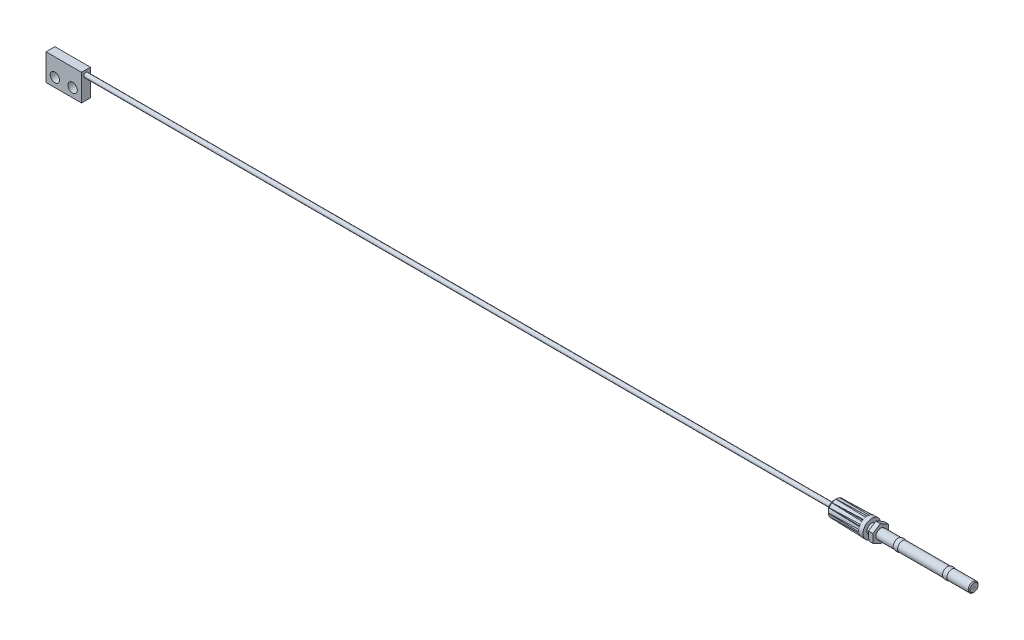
ISO-10303-21;
HEADER;
FILE_DESCRIPTION(('STEP AP214'),'2;1');
FILE_NAME('part.step','',(''),(''),'','','');
FILE_SCHEMA(('AUTOMOTIVE_DESIGN { 1 0 10303 214 1 1 1 1 }'));
ENDSEC;
DATA;
#1=APPLICATION_CONTEXT('core data for automotive mechanical design processes');
#2=APPLICATION_PROTOCOL_DEFINITION('international standard','automotive_design',2000,#1);
#3=PRODUCT_CONTEXT('',#1,'mechanical');
#4=PRODUCT('Part','Part','',(#3));
#5=PRODUCT_RELATED_PRODUCT_CATEGORY('part','',(#4));
#6=PRODUCT_DEFINITION_FORMATION('','',#4);
#7=PRODUCT_DEFINITION_CONTEXT('part definition',#1,'design');
#8=PRODUCT_DEFINITION('design','',#6,#7);
#9=PRODUCT_DEFINITION_SHAPE('','',#8);
#10=(LENGTH_UNIT() NAMED_UNIT(*) SI_UNIT(.MILLI.,.METRE.));
#11=(NAMED_UNIT(*) PLANE_ANGLE_UNIT() SI_UNIT($,.RADIAN.));
#12=(NAMED_UNIT(*) SI_UNIT($,.STERADIAN.) SOLID_ANGLE_UNIT());
#13=UNCERTAINTY_MEASURE_WITH_UNIT(LENGTH_MEASURE(1.E-05),#10,'distance_accuracy_value','');
#14=(GEOMETRIC_REPRESENTATION_CONTEXT(3) GLOBAL_UNCERTAINTY_ASSIGNED_CONTEXT((#13)) GLOBAL_UNIT_ASSIGNED_CONTEXT((#10,
#11,#12)) REPRESENTATION_CONTEXT('',''));
#15=CARTESIAN_POINT('',(0.,0.,0.));
#16=DIRECTION('',(0.,0.,1.));
#17=DIRECTION('',(1.,0.,0.));
#18=AXIS2_PLACEMENT_3D('',#15,#16,#17);
#19=CARTESIAN_POINT('',(174.390646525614,5.40544203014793,58.0401031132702));
#20=DIRECTION('',(-1.,0.,5.61338216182E-13));
#21=DIRECTION('',(0.,-0.999006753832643,-0.0445590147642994));
#22=AXIS2_PLACEMENT_3D('',#19,#20,#21);
#23=PLANE('',#22);
#24=CARTESIAN_POINT('',(174.390646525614,4.50633595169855,57.9999999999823));
#25=DIRECTION('',(-1.,0.,5.61338216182E-13));
#26=DIRECTION('',(0.,-0.999006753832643,-0.0445590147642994));
#27=AXIS2_PLACEMENT_3D('',#24,#25,#26);
#28=CIRCLE('',#27,0.9);
#29=CARTESIAN_POINT('',(174.390646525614,3.60722987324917,57.9598968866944));
#30=VERTEX_POINT('',#29);
#31=EDGE_CURVE('E764',#30,#30,#28,.T.);
#32=ORIENTED_EDGE('',*,*,#31,.F.);
#33=EDGE_LOOP('',(#32));
#34=FACE_BOUND('',#33,.T.);
#35=CARTESIAN_POINT('',(174.390646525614,4.50633595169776,58.));
#36=DIRECTION('',(1.,0.,0.));
#37=DIRECTION('',(0.,0.,-1.));
#38=AXIS2_PLACEMENT_3D('',#35,#36,#37);
#39=CIRCLE('',#38,0.25);
#40=CARTESIAN_POINT('',(174.390646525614,4.50633595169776,57.75));
#41=VERTEX_POINT('',#40);
#42=EDGE_CURVE('E347',#41,#41,#39,.F.);
#43=ORIENTED_EDGE('',*,*,#42,.T.);
#44=EDGE_LOOP('',(#43));
#45=FACE_BOUND('',#44,.T.);
#46=ADVANCED_FACE('F16',(#34,#45),#23,.F.);
#47=CARTESIAN_POINT('',(142.890646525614,6.30454810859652,58.0802062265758));
#48=DIRECTION('',(1.,0.,-5.61338216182E-13));
#49=DIRECTION('',(0.,0.999006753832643,0.0445590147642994));
#50=AXIS2_PLACEMENT_3D('',#47,#48,#49);
#51=PLANE('',#50);
#52=CARTESIAN_POINT('',(142.890646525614,4.50633595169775,58.));
#53=DIRECTION('',(1.,0.,-5.61338216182E-13));
#54=DIRECTION('',(-5.61897750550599E-13,0.0445590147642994,-0.999006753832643));
#55=AXIS2_PLACEMENT_3D('',#52,#53,#54);
#56=CIRCLE('',#55,0.85);
#57=CARTESIAN_POINT('',(142.890646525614,4.5442111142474,57.1508442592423));
#58=VERTEX_POINT('',#57);
#59=EDGE_CURVE('E10',#58,#58,#56,.T.);
#60=ORIENTED_EDGE('',*,*,#59,.T.);
#61=EDGE_LOOP('',(#60));
#62=FACE_BOUND('',#61,.T.);
#63=CARTESIAN_POINT('',(142.890646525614,4.50633595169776,58.));
#64=DIRECTION('',(1.,0.,-5.61339647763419E-13));
#65=DIRECTION('',(-5.618977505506E-13,0.0445590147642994,-0.999006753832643));
#66=AXIS2_PLACEMENT_3D('',#63,#64,#65);
#67=CIRCLE('',#66,1.3);
#68=CARTESIAN_POINT('',(142.890646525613,4.56426267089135,56.7012912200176));
#69=VERTEX_POINT('',#68);
#70=EDGE_CURVE('E391',#69,#69,#67,.T.);
#71=ORIENTED_EDGE('',*,*,#70,.F.);
#72=EDGE_LOOP('',(#71));
#73=FACE_BOUND('',#72,.T.);
#74=ADVANCED_FACE('F690',(#62,#73),#51,.F.);
#75=CARTESIAN_POINT('',(153.390646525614,5.60524338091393,58.0490149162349));
#76=DIRECTION('',(-1.,0.,5.61338216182E-13));
#77=DIRECTION('',(0.,-0.999006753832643,-0.0445590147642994));
#78=AXIS2_PLACEMENT_3D('',#75,#76,#77);
#79=PLANE('',#78);
#80=CARTESIAN_POINT('',(153.390646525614,4.50633595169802,57.9999999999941));
#81=DIRECTION('',(-1.,0.,5.61338216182E-13));
#82=DIRECTION('',(0.,-0.999006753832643,-0.0445590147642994));
#83=AXIS2_PLACEMENT_3D('',#80,#81,#82);
#84=CIRCLE('',#83,1.1);
#85=CARTESIAN_POINT('',(153.390646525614,3.40742852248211,57.9509850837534));
#86=VERTEX_POINT('',#85);
#87=EDGE_CURVE('E740',#86,#86,#84,.T.);
#88=ORIENTED_EDGE('',*,*,#87,.T.);
#89=EDGE_LOOP('',(#88));
#90=FACE_BOUND('',#89,.T.);
#91=DIRECTION('',(4.86601662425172E-13,0.460914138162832,0.887444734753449));
#92=VECTOR('',#91,1.);
#93=CARTESIAN_POINT('',(153.390646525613,5.58252118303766,56.3142285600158));
#94=LINE('',#93,#92);
#95=CARTESIAN_POINT('',(153.390646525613,5.58252118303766,56.3142285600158));
#96=VERTEX_POINT('',#95);
#97=CARTESIAN_POINT('',(153.390646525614,6.50434945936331,58.0891180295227));
#98=VERTEX_POINT('',#97);
#99=EDGE_CURVE('E356',#96,#98,#94,.T.);
#100=ORIENTED_EDGE('',*,*,#99,.T.);
#101=DIRECTION('',(4.86633790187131E-13,-0.538092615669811,0.842885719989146));
#102=VECTOR('',#101,1.);
#103=CARTESIAN_POINT('',(153.390646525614,6.50434945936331,58.0891180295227));
#104=LINE('',#103,#102);
#105=CARTESIAN_POINT('',(153.390646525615,5.42816422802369,59.774889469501));
#106=VERTEX_POINT('',#105);
#107=EDGE_CURVE('E377',#98,#106,#104,.T.);
#108=ORIENTED_EDGE('',*,*,#107,.T.);
#109=DIRECTION('',(0.,-0.999006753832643,-0.044559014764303));
#110=VECTOR('',#109,1.);
#111=CARTESIAN_POINT('',(153.390646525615,5.42816422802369,59.774889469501));
#112=LINE('',#111,#110);
#113=CARTESIAN_POINT('',(153.390646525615,3.4301507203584,59.6857714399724));
#114=VERTEX_POINT('',#113);
#115=EDGE_CURVE('E31',#106,#114,#112,.T.);
#116=ORIENTED_EDGE('',*,*,#115,.T.);
#117=DIRECTION('',(-4.86601662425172E-13,-0.460914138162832,-0.887444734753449));
#118=VECTOR('',#117,1.);
#119=CARTESIAN_POINT('',(153.390646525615,3.4301507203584,59.6857714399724));
#120=LINE('',#119,#118);
#121=CARTESIAN_POINT('',(153.390646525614,2.50832244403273,57.9108819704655));
#122=VERTEX_POINT('',#121);
#123=EDGE_CURVE('E381',#114,#122,#120,.T.);
#124=ORIENTED_EDGE('',*,*,#123,.T.);
#125=DIRECTION('',(-4.86633790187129E-13,0.538092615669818,-0.842885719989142));
#126=VECTOR('',#125,1.);
#127=CARTESIAN_POINT('',(153.390646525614,2.50832244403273,57.9108819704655));
#128=LINE('',#127,#126);
#129=CARTESIAN_POINT('',(153.390646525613,3.58450767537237,56.2251105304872));
#130=VERTEX_POINT('',#129);
#131=EDGE_CURVE('E384',#122,#130,#128,.T.);
#132=ORIENTED_EDGE('',*,*,#131,.T.);
#133=DIRECTION('',(0.,0.999006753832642,0.0445590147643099));
#134=VECTOR('',#133,1.);
#135=CARTESIAN_POINT('',(153.390646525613,3.58450767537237,56.2251105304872));
#136=LINE('',#135,#134);
#137=EDGE_CURVE('E359',#130,#96,#136,.T.);
#138=ORIENTED_EDGE('',*,*,#137,.T.);
#139=EDGE_LOOP('',(#100,#108,#116,#124,#132,#138));
#140=FACE_BOUND('',#139,.T.);
#141=ADVANCED_FACE('F697',(#90,#140),#79,.F.);
#142=CARTESIAN_POINT('',(142.890646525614,4.50633595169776,58.));
#143=DIRECTION('',(-1.,0.,5.61338216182E-13));
#144=DIRECTION('',(0.,-0.999006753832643,-0.0445590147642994));
#145=AXIS2_PLACEMENT_3D('',#142,#143,#144);
#146=CYLINDRICAL_SURFACE('',#145,1.1);
#147=ORIENTED_EDGE('',*,*,#87,.F.);
#148=EDGE_LOOP('',(#147));
#149=FACE_BOUND('',#148,.T.);
#150=CARTESIAN_POINT('',(157.290646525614,4.50633595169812,57.9999999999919));
#151=DIRECTION('',(-1.,0.,5.61338216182E-13));
#152=DIRECTION('',(0.,-0.999006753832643,-0.0445590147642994));
#153=AXIS2_PLACEMENT_3D('',#150,#151,#152);
#154=CIRCLE('',#153,1.1);
#155=CARTESIAN_POINT('',(157.290646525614,3.40742852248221,57.9509850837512));
#156=VERTEX_POINT('',#155);
#157=EDGE_CURVE('E743',#156,#156,#154,.T.);
#158=ORIENTED_EDGE('',*,*,#157,.T.);
#159=EDGE_LOOP('',(#158));
#160=FACE_BOUND('',#159,.T.);
#161=ADVANCED_FACE('F727',(#149,#160),#146,.T.);
#162=CARTESIAN_POINT('',(174.390646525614,4.50633595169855,57.9999999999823));
#163=DIRECTION('',(-1.,0.,5.61338216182E-13));
#164=DIRECTION('',(0.,-0.999006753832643,-0.0445590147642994));
#165=AXIS2_PLACEMENT_3D('',#162,#163,#164);
#166=CONICAL_SURFACE('',#165,0.9,0.785398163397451);
#167=CARTESIAN_POINT('',(174.190646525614,4.50633595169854,57.9999999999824));
#168=DIRECTION('',(-1.,0.,5.61338216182E-13));
#169=DIRECTION('',(0.,-0.999006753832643,-0.0445590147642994));
#170=AXIS2_PLACEMENT_3D('',#167,#168,#169);
#171=CIRCLE('',#170,1.1);
#172=CARTESIAN_POINT('',(174.190646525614,3.40742852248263,57.9509850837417));
#173=VERTEX_POINT('',#172);
#174=EDGE_CURVE('E761',#173,#173,#171,.T.);
#175=ORIENTED_EDGE('',*,*,#174,.F.);
#176=EDGE_LOOP('',(#175));
#177=FACE_BOUND('',#176,.T.);
#178=ORIENTED_EDGE('',*,*,#31,.T.);
#179=EDGE_LOOP('',(#178));
#180=FACE_BOUND('',#179,.T.);
#181=ADVANCED_FACE('F703',(#177,#180),#166,.T.);
#182=CARTESIAN_POINT('',(142.890646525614,4.50633595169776,58.));
#183=DIRECTION('',(-1.,0.,5.61338216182E-13));
#184=DIRECTION('',(0.,-0.999006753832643,-0.0445590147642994));
#185=AXIS2_PLACEMENT_3D('',#182,#183,#184);
#186=CYLINDRICAL_SURFACE('',#185,1.1);
#187=CARTESIAN_POINT('',(169.390646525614,4.50633595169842,57.9999999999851));
#188=DIRECTION('',(-1.,0.,5.61338216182E-13));
#189=DIRECTION('',(0.,-0.999006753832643,-0.0445590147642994));
#190=AXIS2_PLACEMENT_3D('',#187,#188,#189);
#191=CIRCLE('',#190,1.1);
#192=CARTESIAN_POINT('',(169.390646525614,3.40742852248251,57.9509850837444));
#193=VERTEX_POINT('',#192);
#194=EDGE_CURVE('E758',#193,#193,#191,.T.);
#195=ORIENTED_EDGE('',*,*,#194,.F.);
#196=EDGE_LOOP('',(#195));
#197=FACE_BOUND('',#196,.T.);
#198=ORIENTED_EDGE('',*,*,#174,.T.);
#199=EDGE_LOOP('',(#198));
#200=FACE_BOUND('',#199,.T.);
#201=ADVANCED_FACE('F735',(#197,#200),#186,.T.);
#202=CARTESIAN_POINT('',(168.890646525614,4.50633595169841,57.9999999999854));
#203=DIRECTION('',(-1.,0.,5.61338216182E-13));
#204=DIRECTION('',(0.,-0.999006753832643,-0.0445590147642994));
#205=AXIS2_PLACEMENT_3D('',#202,#203,#204);
#206=DEGENERATE_TOROIDAL_SURFACE('',#205,0.1,1.3,.F.);
#207=CARTESIAN_POINT('',(168.390646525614,4.5063359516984,57.9999999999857));
#208=DIRECTION('',(-1.,0.,5.61338216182E-13));
#209=DIRECTION('',(0.,-0.999006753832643,-0.0445590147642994));
#210=AXIS2_PLACEMENT_3D('',#207,#208,#209);
#211=CIRCLE('',#210,1.1);
#212=CARTESIAN_POINT('',(168.390646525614,3.40742852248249,57.950985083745));
#213=VERTEX_POINT('',#212);
#214=EDGE_CURVE('E749',#213,#213,#211,.T.);
#215=ORIENTED_EDGE('',*,*,#214,.F.);
#216=EDGE_LOOP('',(#215));
#217=FACE_BOUND('',#216,.T.);
#218=ORIENTED_EDGE('',*,*,#194,.T.);
#219=EDGE_LOOP('',(#218));
#220=FACE_BOUND('',#219,.T.);
#221=ADVANCED_FACE('F1604',(#217,#220),#206,.F.);
#222=CARTESIAN_POINT('',(142.890646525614,4.50633595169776,58.));
#223=DIRECTION('',(-1.,0.,5.61338216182E-13));
#224=DIRECTION('',(0.,-0.999006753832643,-0.0445590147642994));
#225=AXIS2_PLACEMENT_3D('',#222,#223,#224);
#226=CYLINDRICAL_SURFACE('',#225,1.1);
#227=CARTESIAN_POINT('',(158.290646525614,4.50633595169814,57.9999999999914));
#228=DIRECTION('',(-1.,0.,5.61338216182E-13));
#229=DIRECTION('',(0.,-0.999006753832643,-0.0445590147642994));
#230=AXIS2_PLACEMENT_3D('',#227,#228,#229);
#231=CIRCLE('',#230,1.1);
#232=CARTESIAN_POINT('',(158.290646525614,3.40742852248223,57.9509850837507));
#233=VERTEX_POINT('',#232);
#234=EDGE_CURVE('E745',#233,#233,#231,.T.);
#235=ORIENTED_EDGE('',*,*,#234,.F.);
#236=EDGE_LOOP('',(#235));
#237=FACE_BOUND('',#236,.T.);
#238=ORIENTED_EDGE('',*,*,#214,.T.);
#239=EDGE_LOOP('',(#238));
#240=FACE_BOUND('',#239,.T.);
#241=ADVANCED_FACE('F1595',(#237,#240),#226,.T.);
#242=CARTESIAN_POINT('',(157.790646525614,4.50633595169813,57.9999999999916));
#243=DIRECTION('',(-1.,0.,5.61338216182E-13));
#244=DIRECTION('',(0.,-0.999006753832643,-0.0445590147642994));
#245=AXIS2_PLACEMENT_3D('',#242,#243,#244);
#246=DEGENERATE_TOROIDAL_SURFACE('',#245,0.1,1.3,.F.);
#247=ORIENTED_EDGE('',*,*,#157,.F.);
#248=EDGE_LOOP('',(#247));
#249=FACE_BOUND('',#248,.T.);
#250=ORIENTED_EDGE('',*,*,#234,.T.);
#251=EDGE_LOOP('',(#250));
#252=FACE_BOUND('',#251,.T.);
#253=ADVANCED_FACE('F1587',(#249,#252),#246,.F.);
#254=CARTESIAN_POINT('',(152.390646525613,5.58252118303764,56.3142285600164));
#255=DIRECTION('',(-2.80976698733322E-13,0.887444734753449,-0.460914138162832));
#256=DIRECTION('',(4.86617726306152E-13,0.460914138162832,0.887444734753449));
#257=AXIS2_PLACEMENT_3D('',#254,#255,#256);
#258=PLANE('',#257);
#259=ORIENTED_EDGE('',*,*,#99,.F.);
#260=DIRECTION('',(1.,0.,-5.61338216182E-13));
#261=VECTOR('',#260,1.);
#262=CARTESIAN_POINT('',(152.390646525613,5.58252118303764,56.3142285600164));
#263=LINE('',#262,#261);
#264=CARTESIAN_POINT('',(152.390646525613,5.58252118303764,56.3142285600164));
#265=VERTEX_POINT('',#264);
#266=EDGE_CURVE('E389',#265,#96,#263,.T.);
#267=ORIENTED_EDGE('',*,*,#266,.F.);
#268=DIRECTION('',(4.86601662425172E-13,0.460914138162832,0.887444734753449));
#269=VECTOR('',#268,1.);
#270=CARTESIAN_POINT('',(152.390646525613,5.58252118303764,56.3142285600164));
#271=LINE('',#270,#269);
#272=CARTESIAN_POINT('',(152.390646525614,6.50434945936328,58.0891180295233));
#273=VERTEX_POINT('',#272);
#274=EDGE_CURVE('E39',#265,#273,#271,.T.);
#275=ORIENTED_EDGE('',*,*,#274,.T.);
#276=DIRECTION('',(1.,0.,-5.61338216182E-13));
#277=VECTOR('',#276,1.);
#278=CARTESIAN_POINT('',(152.390646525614,6.50434945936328,58.0891180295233));
#279=LINE('',#278,#277);
#280=EDGE_CURVE('E374',#273,#98,#279,.T.);
#281=ORIENTED_EDGE('',*,*,#280,.T.);
#282=EDGE_LOOP('',(#259,#267,#275,#281));
#283=FACE_BOUND('',#282,.T.);
#284=ADVANCED_FACE('F425',(#283),#258,.T.);
#285=CARTESIAN_POINT('',(152.390646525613,3.58450767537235,56.2251105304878));
#286=DIRECTION('',(-5.618977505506E-13,0.0445590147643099,-0.999006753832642));
#287=DIRECTION('',(0.,0.999006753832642,0.0445590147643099));
#288=AXIS2_PLACEMENT_3D('',#285,#286,#287);
#289=PLANE('',#288);
#290=ORIENTED_EDGE('',*,*,#137,.F.);
#291=DIRECTION('',(1.,0.,-5.61338216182E-13));
#292=VECTOR('',#291,1.);
#293=CARTESIAN_POINT('',(152.390646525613,3.58450767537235,56.2251105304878));
#294=LINE('',#293,#292);
#295=CARTESIAN_POINT('',(152.390646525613,3.58450767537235,56.2251105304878));
#296=VERTEX_POINT('',#295);
#297=EDGE_CURVE('E392',#296,#130,#294,.T.);
#298=ORIENTED_EDGE('',*,*,#297,.F.);
#299=DIRECTION('',(0.,0.999006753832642,0.0445590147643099));
#300=VECTOR('',#299,1.);
#301=CARTESIAN_POINT('',(152.390646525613,3.58450767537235,56.2251105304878));
#302=LINE('',#301,#300);
#303=EDGE_CURVE('E371',#296,#265,#302,.T.);
#304=ORIENTED_EDGE('',*,*,#303,.T.);
#305=ORIENTED_EDGE('',*,*,#266,.T.);
#306=EDGE_LOOP('',(#290,#298,#304,#305));
#307=FACE_BOUND('',#306,.T.);
#308=ADVANCED_FACE('F1569',(#307),#289,.T.);
#309=CARTESIAN_POINT('',(152.390646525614,2.50832244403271,57.9108819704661));
#310=DIRECTION('',(-2.80921051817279E-13,-0.842885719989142,-0.538092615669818));
#311=DIRECTION('',(-4.86617726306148E-13,0.538092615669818,-0.842885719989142));
#312=AXIS2_PLACEMENT_3D('',#309,#310,#311);
#313=PLANE('',#312);
#314=ORIENTED_EDGE('',*,*,#131,.F.);
#315=DIRECTION('',(1.,0.,-5.61338216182E-13));
#316=VECTOR('',#315,1.);
#317=CARTESIAN_POINT('',(152.390646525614,2.50832244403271,57.9108819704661));
#318=LINE('',#317,#316);
#319=CARTESIAN_POINT('',(152.390646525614,2.50832244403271,57.9108819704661));
#320=VERTEX_POINT('',#319);
#321=EDGE_CURVE('E394',#320,#122,#318,.T.);
#322=ORIENTED_EDGE('',*,*,#321,.F.);
#323=DIRECTION('',(-4.86633790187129E-13,0.538092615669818,-0.842885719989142));
#324=VECTOR('',#323,1.);
#325=CARTESIAN_POINT('',(152.390646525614,2.50832244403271,57.9108819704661));
#326=LINE('',#325,#324);
#327=EDGE_CURVE('E368',#320,#296,#326,.T.);
#328=ORIENTED_EDGE('',*,*,#327,.T.);
#329=ORIENTED_EDGE('',*,*,#297,.T.);
#330=EDGE_LOOP('',(#314,#322,#328,#329));
#331=FACE_BOUND('',#330,.T.);
#332=ADVANCED_FACE('F1560',(#331),#313,.T.);
#333=CARTESIAN_POINT('',(152.390646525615,3.43015072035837,59.685771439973));
#334=DIRECTION('',(2.80976698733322E-13,-0.887444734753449,0.460914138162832));
#335=DIRECTION('',(-4.86617726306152E-13,-0.460914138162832,-0.887444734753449));
#336=AXIS2_PLACEMENT_3D('',#333,#334,#335);
#337=PLANE('',#336);
#338=ORIENTED_EDGE('',*,*,#123,.F.);
#339=DIRECTION('',(1.,0.,-5.61338216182E-13));
#340=VECTOR('',#339,1.);
#341=CARTESIAN_POINT('',(152.390646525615,3.43015072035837,59.685771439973));
#342=LINE('',#341,#340);
#343=CARTESIAN_POINT('',(152.390646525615,3.43015072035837,59.685771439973));
#344=VERTEX_POINT('',#343);
#345=EDGE_CURVE('E396',#344,#114,#342,.T.);
#346=ORIENTED_EDGE('',*,*,#345,.F.);
#347=DIRECTION('',(-4.86601662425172E-13,-0.460914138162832,-0.887444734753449));
#348=VECTOR('',#347,1.);
#349=CARTESIAN_POINT('',(152.390646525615,3.43015072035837,59.685771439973));
#350=LINE('',#349,#348);
#351=EDGE_CURVE('E365',#344,#320,#350,.T.);
#352=ORIENTED_EDGE('',*,*,#351,.T.);
#353=ORIENTED_EDGE('',*,*,#321,.T.);
#354=EDGE_LOOP('',(#338,#346,#352,#353));
#355=FACE_BOUND('',#354,.T.);
#356=ADVANCED_FACE('F1552',(#355),#337,.T.);
#357=CARTESIAN_POINT('',(152.390646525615,5.42816422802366,59.7748894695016));
#358=DIRECTION('',(5.618977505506E-13,-0.044559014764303,0.999006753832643));
#359=DIRECTION('',(0.,-0.999006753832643,-0.044559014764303));
#360=AXIS2_PLACEMENT_3D('',#357,#358,#359);
#361=PLANE('',#360);
#362=ORIENTED_EDGE('',*,*,#115,.F.);
#363=DIRECTION('',(1.,0.,-5.61338216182E-13));
#364=VECTOR('',#363,1.);
#365=CARTESIAN_POINT('',(152.390646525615,5.42816422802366,59.7748894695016));
#366=LINE('',#365,#364);
#367=CARTESIAN_POINT('',(152.390646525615,5.42816422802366,59.7748894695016));
#368=VERTEX_POINT('',#367);
#369=EDGE_CURVE('E398',#368,#106,#366,.T.);
#370=ORIENTED_EDGE('',*,*,#369,.F.);
#371=DIRECTION('',(0.,-0.999006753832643,-0.044559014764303));
#372=VECTOR('',#371,1.);
#373=CARTESIAN_POINT('',(152.390646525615,5.42816422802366,59.7748894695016));
#374=LINE('',#373,#372);
#375=EDGE_CURVE('E362',#368,#344,#374,.T.);
#376=ORIENTED_EDGE('',*,*,#375,.T.);
#377=ORIENTED_EDGE('',*,*,#345,.T.);
#378=EDGE_LOOP('',(#362,#370,#376,#377));
#379=FACE_BOUND('',#378,.T.);
#380=ADVANCED_FACE('F1544',(#379),#361,.T.);
#381=CARTESIAN_POINT('',(152.390646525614,6.50434945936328,58.0891180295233));
#382=DIRECTION('',(2.80921051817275E-13,0.842885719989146,0.538092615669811));
#383=DIRECTION('',(4.86617726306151E-13,-0.538092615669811,0.842885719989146));
#384=AXIS2_PLACEMENT_3D('',#381,#382,#383);
#385=PLANE('',#384);
#386=ORIENTED_EDGE('',*,*,#107,.F.);
#387=ORIENTED_EDGE('',*,*,#280,.F.);
#388=DIRECTION('',(4.86633790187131E-13,-0.538092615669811,0.842885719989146));
#389=VECTOR('',#388,1.);
#390=CARTESIAN_POINT('',(152.390646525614,6.50434945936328,58.0891180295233));
#391=LINE('',#390,#389);
#392=EDGE_CURVE('E358',#273,#368,#391,.T.);
#393=ORIENTED_EDGE('',*,*,#392,.T.);
#394=ORIENTED_EDGE('',*,*,#369,.T.);
#395=EDGE_LOOP('',(#386,#387,#393,#394));
#396=FACE_BOUND('',#395,.T.);
#397=ADVANCED_FACE('F423',(#396),#385,.T.);
#398=CARTESIAN_POINT('',(142.890646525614,4.50633595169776,58.));
#399=DIRECTION('',(1.,0.,-5.61339647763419E-13));
#400=DIRECTION('',(-5.618977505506E-13,0.0445590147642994,-0.999006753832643));
#401=AXIS2_PLACEMENT_3D('',#398,#399,#400);
#402=CONICAL_SURFACE('',#401,1.3,0.81187520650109);
#403=ORIENTED_EDGE('',*,*,#70,.T.);
#404=EDGE_LOOP('',(#403));
#405=FACE_BOUND('',#404,.T.);
#406=CARTESIAN_POINT('',(143.353112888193,4.46573759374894,59.787166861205));
#407=CARTESIAN_POINT('',(143.35935277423,4.45887503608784,59.7935909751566));
#408=CARTESIAN_POINT('',(143.365616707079,4.45202467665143,59.800004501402));
#409=CARTESIAN_POINT('',(143.378192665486,4.43834835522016,59.8128103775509));
#410=CARTESIAN_POINT('',(143.384504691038,4.43152239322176,59.8192027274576));
#411=CARTESIAN_POINT('',(143.390840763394,4.42470862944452,59.8255844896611));
#412=B_SPLINE_CURVE_WITH_KNOTS('',3,(#406,#407,#408,#409,#410,#411),.UNSPECIFIED.,.F.,.F.,(4,2,
4),(0.,0.0338478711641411,0.0676957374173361),.UNSPECIFIED.);
#413=CARTESIAN_POINT('',(143.364846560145,4.45287781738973,59.7992059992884));
#414=VERTEX_POINT('',#413);
#415=CARTESIAN_POINT('',(143.390646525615,4.42491755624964,59.8253888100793));
#416=VERTEX_POINT('',#415);
#417=EDGE_CURVE('E587',#414,#416,#412,.T.);
#418=ORIENTED_EDGE('',*,*,#417,.F.);
#419=CARTESIAN_POINT('',(143.364846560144,4.50633595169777,58.));
#420=DIRECTION('',(1.,0.,-5.61339647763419E-13));
#421=DIRECTION('',(-5.618977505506E-13,0.0445590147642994,-0.999006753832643));
#422=AXIS2_PLACEMENT_3D('',#419,#420,#421);
#423=CIRCLE('',#422,1.8);
#424=CARTESIAN_POINT('',(143.364846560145,5.31213649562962,59.6095606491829));
#425=VERTEX_POINT('',#424);
#426=EDGE_CURVE('E810',#425,#414,#423,.T.);
#427=ORIENTED_EDGE('',*,*,#426,.F.);
#428=CARTESIAN_POINT('',(143.390846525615,5.3487999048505,59.6216344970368));
#429=CARTESIAN_POINT('',(143.383991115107,5.33920648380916,59.6184742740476));
#430=CARTESIAN_POINT('',(143.377163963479,5.3295948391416,59.6153088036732));
#431=CARTESIAN_POINT('',(143.363566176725,5.31033510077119,59.608967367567));
#432=CARTESIAN_POINT('',(143.35679554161,5.30068700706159,59.6057914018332));
#433=CARTESIAN_POINT('',(143.350053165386,5.29102068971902,59.6026101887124));
#434=B_SPLINE_CURVE_WITH_KNOTS('',3,(#428,#429,#430,#431,#432,#433),.UNSPECIFIED.,.F.,.F.,(4,2,
4),(0.,0.0366213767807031,0.0732427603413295),.UNSPECIFIED.);
#435=CARTESIAN_POINT('',(143.390646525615,5.3485199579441,59.6215422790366));
#436=VERTEX_POINT('',#435);
#437=EDGE_CURVE('E566',#436,#425,#434,.T.);
#438=ORIENTED_EDGE('',*,*,#437,.F.);
#439=CARTESIAN_POINT('',(143.294796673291,5.39080633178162,59.482318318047));
#440=CARTESIAN_POINT('',(143.310459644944,5.38366993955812,59.5057845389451));
#441=CARTESIAN_POINT('',(143.326295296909,5.37657074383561,59.5291431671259));
#442=CARTESIAN_POINT('',(143.358311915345,5.36244676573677,59.5756451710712));
#443=CARTESIAN_POINT('',(143.374492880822,5.35542198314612,59.5987885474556));
#444=CARTESIAN_POINT('',(143.390846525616,5.34843439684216,59.6218243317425));
#445=B_SPLINE_CURVE_WITH_KNOTS('',3,(#439,#440,#441,#442,#443,#444),.UNSPECIFIED.,.F.,.F.,(4,2,
4),(0.,0.0872990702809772,0.174597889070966),.UNSPECIFIED.);
#446=CARTESIAN_POINT('',(143.364846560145,5.35964284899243,59.5848871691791));
#447=VERTEX_POINT('',#446);
#448=EDGE_CURVE('E544',#447,#436,#445,.T.);
#449=ORIENTED_EDGE('',*,*,#448,.F.);
#450=CARTESIAN_POINT('',(143.364846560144,4.50633595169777,58.));
#451=DIRECTION('',(1.,0.,-5.61339647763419E-13));
#452=DIRECTION('',(-5.618977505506E-13,0.0445590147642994,-0.999006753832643));
#453=AXIS2_PLACEMENT_3D('',#450,#451,#452);
#454=CIRCLE('',#453,1.8);
#455=CARTESIAN_POINT('',(143.364846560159,6.00896001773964,58.9910201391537));
#456=VERTEX_POINT('',#455);
#457=EDGE_CURVE('E1008',#456,#447,#454,.T.);
#458=ORIENTED_EDGE('',*,*,#457,.F.);
#459=CARTESIAN_POINT('',(143.390846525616,6.04674838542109,58.9831446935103));
#460=CARTESIAN_POINT('',(143.374492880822,6.02318197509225,58.9880536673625));
#461=CARTESIAN_POINT('',(143.358311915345,5.9995050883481,58.9929901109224));
#462=CARTESIAN_POINT('',(143.326295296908,5.9519302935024,59.0029179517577));
#463=CARTESIAN_POINT('',(143.310459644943,5.92803238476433,59.0079093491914));
#464=CARTESIAN_POINT('',(143.29479667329,5.90402399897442,59.012928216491));
#465=B_SPLINE_CURVE_WITH_KNOTS('',3,(#459,#460,#461,#462,#463,#464),.UNSPECIFIED.,.F.,.F.,(4,2,
4),(0.,0.0872988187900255,0.174597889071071),.UNSPECIFIED.);
#466=CARTESIAN_POINT('',(143.390646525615,6.04645983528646,58.983204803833));
#467=VERTEX_POINT('',#466);
#468=EDGE_CURVE('E522',#467,#456,#465,.T.);
#469=ORIENTED_EDGE('',*,*,#468,.F.);
#470=CARTESIAN_POINT('',(143.350053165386,6.03272205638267,58.9242483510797));
#471=CARTESIAN_POINT('',(143.35679554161,6.03503004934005,58.9341595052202));
#472=CARTESIAN_POINT('',(143.363566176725,6.03733443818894,58.9440520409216));
#473=CARTESIAN_POINT('',(143.377163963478,6.04193600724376,58.9637998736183));
#474=CARTESIAN_POINT('',(143.383991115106,6.04423318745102,58.9736551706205));
#475=CARTESIAN_POINT('',(143.390846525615,6.04652676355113,58.9834918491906));
#476=B_SPLINE_CURVE_WITH_KNOTS('',3,(#470,#471,#472,#473,#474,#475),.UNSPECIFIED.,.F.,.F.,(4,2,
4),(0.,0.0366213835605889,0.073242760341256),.UNSPECIFIED.);
#477=CARTESIAN_POINT('',(143.364846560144,6.0377649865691,58.9458991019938));
#478=VERTEX_POINT('',#477);
#479=EDGE_CURVE('E501',#478,#467,#476,.T.);
#480=ORIENTED_EDGE('',*,*,#479,.F.);
#481=CARTESIAN_POINT('',(143.364846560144,4.50633595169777,58.));
#482=DIRECTION('',(1.,0.,-5.61339647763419E-13));
#483=DIRECTION('',(-5.618977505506E-13,0.0445590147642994,-0.999006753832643));
#484=AXIS2_PLACEMENT_3D('',#481,#482,#483);
#485=CIRCLE('',#484,1.8);
#486=CARTESIAN_POINT('',(143.364846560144,6.30315663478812,58.106936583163));
#487=VERTEX_POINT('',#486);
#488=EDGE_CURVE('E987',#487,#478,#485,.T.);
#489=ORIENTED_EDGE('',*,*,#488,.F.);
#490=CARTESIAN_POINT('',(143.390836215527,6.33193326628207,58.0812321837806));
#491=CARTESIAN_POINT('',(143.384500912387,6.32497104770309,58.0874499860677));
#492=CARTESIAN_POINT('',(143.378189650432,6.31799720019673,58.0936789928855));
#493=CARTESIAN_POINT('',(143.36561520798,6.30402624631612,58.1061594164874));
#494=CARTESIAN_POINT('',(143.35935202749,6.2970291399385,58.1124108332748));
#495=CARTESIAN_POINT('',(143.353112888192,6.29002040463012,58.1186734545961));
#496=B_SPLINE_CURVE_WITH_KNOTS('',3,(#490,#491,#492,#493,#494,#495),.UNSPECIFIED.,.F.,.F.,(4,2,
4),(0.,0.0338438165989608,0.0676876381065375),.UNSPECIFIED.);
#497=CARTESIAN_POINT('',(143.390646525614,6.33172476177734,58.0814183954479));
#498=VERTEX_POINT('',#497);
#499=EDGE_CURVE('E479',#498,#487,#496,.T.);
#500=ORIENTED_EDGE('',*,*,#499,.F.);
#501=CARTESIAN_POINT('',(143.353112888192,6.29350281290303,58.0405983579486));
#502=CARTESIAN_POINT('',(143.35935202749,6.29992615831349,58.047460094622));
#503=CARTESIAN_POINT('',(143.36561520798,6.30633891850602,58.0543096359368));
#504=CARTESIAN_POINT('',(143.378189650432,6.31914326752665,58.0679843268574));
#505=CARTESIAN_POINT('',(143.384500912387,6.32553485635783,58.0748094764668));
#506=CARTESIAN_POINT('',(143.390836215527,6.33191585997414,58.0816224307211));
#507=B_SPLINE_CURVE_WITH_KNOTS('',3,(#501,#502,#503,#504,#505,#506),.UNSPECIFIED.,.F.,.F.,(4,2,
4),(0.,0.0338438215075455,0.0676876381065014),.UNSPECIFIED.);
#508=CARTESIAN_POINT('',(143.364846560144,6.30554195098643,58.0534581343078));
#509=VERTEX_POINT('',#508);
#510=EDGE_CURVE('E457',#509,#498,#507,.T.);
#511=ORIENTED_EDGE('',*,*,#510,.F.);
#512=CARTESIAN_POINT('',(143.364846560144,4.50633595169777,58.));
#513=DIRECTION('',(1.,0.,-5.61339647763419E-13));
#514=DIRECTION('',(-5.618977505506E-13,0.0445590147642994,-0.999006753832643));
#515=AXIS2_PLACEMENT_3D('',#512,#513,#514);
#516=CIRCLE('',#515,1.8);
#517=CARTESIAN_POINT('',(143.364846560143,6.11589660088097,57.1941994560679));
#518=VERTEX_POINT('',#517);
#519=EDGE_CURVE('E411',#518,#509,#516,.T.);
#520=ORIENTED_EDGE('',*,*,#519,.F.);
#521=CARTESIAN_POINT('',(143.390846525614,6.12797044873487,57.157536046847));
#522=CARTESIAN_POINT('',(143.383991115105,6.1248102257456,57.1671294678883));
#523=CARTESIAN_POINT('',(143.377163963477,6.12164475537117,57.1767411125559));
#524=CARTESIAN_POINT('',(143.363566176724,6.11530331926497,57.1960008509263));
#525=CARTESIAN_POINT('',(143.356795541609,6.11212735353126,57.2056489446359));
#526=CARTESIAN_POINT('',(143.350053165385,6.10894614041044,57.2153152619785));
#527=B_SPLINE_CURVE_WITH_KNOTS('',3,(#521,#522,#523,#524,#525,#526),.UNSPECIFIED.,.F.,.F.,(4,2,
4),(0.,0.036621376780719,0.0732427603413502),.UNSPECIFIED.);
#528=CARTESIAN_POINT('',(143.390646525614,6.1278782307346,57.1578159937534));
#529=VERTEX_POINT('',#528);
#530=EDGE_CURVE('E433',#529,#518,#527,.T.);
#531=ORIENTED_EDGE('',*,*,#530,.F.);
#532=CARTESIAN_POINT('',(143.294796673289,5.98865426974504,57.1155296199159));
#533=CARTESIAN_POINT('',(143.310459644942,6.0121204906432,57.1226660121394));
#534=CARTESIAN_POINT('',(143.326295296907,6.03547911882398,57.1297652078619));
#535=CARTESIAN_POINT('',(143.358311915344,6.08198112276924,57.1438891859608));
#536=CARTESIAN_POINT('',(143.374492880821,6.10512449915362,57.1509139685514));
#537=CARTESIAN_POINT('',(143.390846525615,6.12816028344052,57.1579015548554));
#538=B_SPLINE_CURVE_WITH_KNOTS('',3,(#532,#533,#534,#535,#536,#537),.UNSPECIFIED.,.F.,.F.,(4,2,
4),(0.,0.0872990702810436,0.174597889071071),.UNSPECIFIED.);
#539=CARTESIAN_POINT('',(143.36484656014,6.09122312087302,57.1466931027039));
#540=VERTEX_POINT('',#539);
#541=EDGE_CURVE('E403',#540,#529,#538,.T.);
#542=ORIENTED_EDGE('',*,*,#541,.F.);
#543=CARTESIAN_POINT('',(143.364846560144,4.50633595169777,58.));
#544=DIRECTION('',(1.,0.,-5.61339647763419E-13));
#545=DIRECTION('',(-5.618977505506E-13,0.0445590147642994,-0.999006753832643));
#546=AXIS2_PLACEMENT_3D('',#543,#544,#545);
#547=CIRCLE('',#546,1.8);
#548=CARTESIAN_POINT('',(143.364846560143,5.49735609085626,56.4973759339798));
#549=VERTEX_POINT('',#548);
#550=EDGE_CURVE('E972',#549,#540,#547,.T.);
#551=ORIENTED_EDGE('',*,*,#550,.F.);
#552=CARTESIAN_POINT('',(143.390846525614,5.48948064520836,56.4595875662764));
#553=CARTESIAN_POINT('',(143.374492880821,5.49438961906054,56.4831539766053));
#554=CARTESIAN_POINT('',(143.358311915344,5.49932606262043,56.5068308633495));
#555=CARTESIAN_POINT('',(143.326295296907,5.50925390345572,56.5544056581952));
#556=CARTESIAN_POINT('',(143.310459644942,5.51424530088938,56.5783035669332));
#557=CARTESIAN_POINT('',(143.294796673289,5.51926416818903,56.6023119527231));
#558=B_SPLINE_CURVE_WITH_KNOTS('',3,(#552,#553,#554,#555,#556,#557),.UNSPECIFIED.,.F.,.F.,(4,2,
4),(0.,0.0872988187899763,0.174597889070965),.UNSPECIFIED.);
#559=CARTESIAN_POINT('',(143.390646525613,5.48954075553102,56.4598761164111));
#560=VERTEX_POINT('',#559);
#561=EDGE_CURVE('E443',#560,#549,#558,.T.);
#562=ORIENTED_EDGE('',*,*,#561,.F.);
#563=CARTESIAN_POINT('',(143.350053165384,5.43058430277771,56.4736138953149));
#564=CARTESIAN_POINT('',(143.356795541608,5.44049545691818,56.4713059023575));
#565=CARTESIAN_POINT('',(143.363566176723,5.4503879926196,56.4690015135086));
#566=CARTESIAN_POINT('',(143.377163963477,5.47013582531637,56.4643999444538));
#567=CARTESIAN_POINT('',(143.383991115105,5.4799911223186,56.4621027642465));
#568=CARTESIAN_POINT('',(143.390846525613,5.48982780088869,56.4598091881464));
#569=B_SPLINE_CURVE_WITH_KNOTS('',3,(#563,#564,#565,#566,#567,#568),.UNSPECIFIED.,.F.,.F.,(4,2,
4),(0.,0.0366213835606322,0.0732427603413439),.UNSPECIFIED.);
#570=CARTESIAN_POINT('',(143.364846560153,5.45223505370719,56.4685709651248));
#571=VERTEX_POINT('',#570);
#572=EDGE_CURVE('E450',#571,#560,#569,.T.);
#573=ORIENTED_EDGE('',*,*,#572,.F.);
#574=CARTESIAN_POINT('',(143.364846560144,4.50633595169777,58.));
#575=DIRECTION('',(1.,0.,-5.61339647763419E-13));
#576=DIRECTION('',(-5.618977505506E-13,0.0445590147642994,-0.999006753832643));
#577=AXIS2_PLACEMENT_3D('',#574,#575,#576);
#578=CIRCLE('',#577,1.8);
#579=CARTESIAN_POINT('',(143.364846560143,4.61327253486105,56.2031793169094));
#580=VERTEX_POINT('',#579);
#581=EDGE_CURVE('E979',#580,#571,#578,.T.);
#582=ORIENTED_EDGE('',*,*,#581,.F.);
#583=CARTESIAN_POINT('',(143.390840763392,4.58756367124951,56.1743976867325));
#584=CARTESIAN_POINT('',(143.384504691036,4.59378221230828,56.1813607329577));
#585=CARTESIAN_POINT('',(143.378192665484,4.60001196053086,56.1883354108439));
#586=CARTESIAN_POINT('',(143.365616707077,4.61249387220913,56.2023080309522));
#587=CARTESIAN_POINT('',(143.359352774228,4.61874603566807,56.2093059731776));
#588=CARTESIAN_POINT('',(143.353112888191,4.62500940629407,56.2163155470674));
#589=B_SPLINE_CURVE_WITH_KNOTS('',3,(#583,#584,#585,#586,#587,#588),.UNSPECIFIED.,.F.,.F.,(4,2,
4),(0.,0.0338478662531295,0.0676957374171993),.UNSPECIFIED.);
#590=CARTESIAN_POINT('',(143.390646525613,4.58775434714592,56.1746111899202));
#591=VERTEX_POINT('',#590);
#592=EDGE_CURVE('E465',#591,#580,#589,.T.);
#593=ORIENTED_EDGE('',*,*,#592,.F.);
#594=CARTESIAN_POINT('',(143.353112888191,4.54693430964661,56.2128331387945));
#595=CARTESIAN_POINT('',(143.359352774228,4.5537968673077,56.2064090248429));
#596=CARTESIAN_POINT('',(143.365616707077,4.5606472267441,56.1999954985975));
#597=CARTESIAN_POINT('',(143.378192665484,4.57432354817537,56.1871896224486));
#598=CARTESIAN_POINT('',(143.384504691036,4.58114951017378,56.1807972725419));
#599=CARTESIAN_POINT('',(143.390840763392,4.58796327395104,56.1744155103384));
#600=B_SPLINE_CURVE_WITH_KNOTS('',3,(#594,#595,#596,#597,#598,#599),.UNSPECIFIED.,.F.,.F.,(4,2,
4),(0.,0.0338478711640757,0.0676957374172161),.UNSPECIFIED.);
#601=CARTESIAN_POINT('',(143.364846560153,4.55979408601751,56.2007940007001));
#602=VERTEX_POINT('',#601);
#603=EDGE_CURVE('E472',#602,#591,#600,.T.);
#604=ORIENTED_EDGE('',*,*,#603,.F.);
#605=CARTESIAN_POINT('',(143.364846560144,4.50633595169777,58.));
#606=DIRECTION('',(1.,0.,-5.61339647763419E-13));
#607=DIRECTION('',(-5.618977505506E-13,0.0445590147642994,-0.999006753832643));
#608=AXIS2_PLACEMENT_3D('',#605,#606,#607);
#609=CIRCLE('',#608,1.8);
#610=CARTESIAN_POINT('',(143.364846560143,3.70053540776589,56.3904393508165));
#611=VERTEX_POINT('',#610);
#612=EDGE_CURVE('E988',#611,#602,#609,.T.);
#613=ORIENTED_EDGE('',*,*,#612,.F.);
#614=CARTESIAN_POINT('',(143.390846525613,3.66387199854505,56.3783655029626));
#615=CARTESIAN_POINT('',(143.383991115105,3.67346541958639,56.3815257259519));
#616=CARTESIAN_POINT('',(143.377163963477,3.68307706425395,56.3846911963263));
#617=CARTESIAN_POINT('',(143.363566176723,3.70233680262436,56.3910326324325));
#618=CARTESIAN_POINT('',(143.356795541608,3.71198489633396,56.3942085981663));
#619=CARTESIAN_POINT('',(143.350053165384,3.72165121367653,56.3973898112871));
#620=B_SPLINE_CURVE_WITH_KNOTS('',3,(#614,#615,#616,#617,#618,#619),.UNSPECIFIED.,.F.,.F.,(4,2,
4),(0.,0.0366213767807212,0.0732427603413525),.UNSPECIFIED.);
#621=CARTESIAN_POINT('',(143.390646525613,3.66415194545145,56.3784577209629));
#622=VERTEX_POINT('',#621);
#623=EDGE_CURVE('E486',#622,#611,#620,.T.);
#624=ORIENTED_EDGE('',*,*,#623,.F.);
#625=CARTESIAN_POINT('',(143.294796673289,3.62186557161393,56.5176816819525));
#626=CARTESIAN_POINT('',(143.310459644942,3.62900196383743,56.4942154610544));
#627=CARTESIAN_POINT('',(143.326295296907,3.63610115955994,56.4708568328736));
#628=CARTESIAN_POINT('',(143.358311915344,3.65022513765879,56.4243548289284));
#629=CARTESIAN_POINT('',(143.374492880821,3.65724992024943,56.4012114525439));
#630=CARTESIAN_POINT('',(143.390846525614,3.66423750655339,56.378175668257));
#631=B_SPLINE_CURVE_WITH_KNOTS('',3,(#625,#626,#627,#628,#629,#630),.UNSPECIFIED.,.F.,.F.,(4,2,
4),(0.,0.0872990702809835,0.174597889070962),.UNSPECIFIED.);
#632=CARTESIAN_POINT('',(143.36484656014,3.65302905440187,56.4151128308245));
#633=VERTEX_POINT('',#632);
#634=EDGE_CURVE('E494',#633,#622,#631,.T.);
#635=ORIENTED_EDGE('',*,*,#634,.F.);
#636=CARTESIAN_POINT('',(143.364846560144,4.50633595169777,58.));
#637=DIRECTION('',(1.,0.,-5.61339647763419E-13));
#638=DIRECTION('',(-5.618977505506E-13,0.0445590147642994,-0.999006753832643));
#639=AXIS2_PLACEMENT_3D('',#636,#637,#638);
#640=CIRCLE('',#639,1.8);
#641=CARTESIAN_POINT('',(143.364846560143,3.00371188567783,57.0089798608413));
#642=VERTEX_POINT('',#641);
#643=EDGE_CURVE('E997',#642,#633,#640,.T.);
#644=ORIENTED_EDGE('',*,*,#643,.F.);
#645=CARTESIAN_POINT('',(143.390846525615,2.96592351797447,57.0168553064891));
#646=CARTESIAN_POINT('',(143.374492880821,2.98948992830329,57.011946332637));
#647=CARTESIAN_POINT('',(143.358311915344,3.01316681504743,57.0070098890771));
#648=CARTESIAN_POINT('',(143.326295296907,3.06074160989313,56.9970820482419));
#649=CARTESIAN_POINT('',(143.310459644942,3.0846395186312,56.9920906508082));
#650=CARTESIAN_POINT('',(143.294796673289,3.10864790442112,56.9870717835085));
#651=B_SPLINE_CURVE_WITH_KNOTS('',3,(#645,#646,#647,#648,#649,#650),.UNSPECIFIED.,.F.,.F.,(4,2,
4),(0.,0.0872988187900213,0.174597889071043),.UNSPECIFIED.);
#652=CARTESIAN_POINT('',(143.390646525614,2.96621206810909,57.0167951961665));
#653=VERTEX_POINT('',#652);
#654=EDGE_CURVE('E508',#653,#642,#651,.T.);
#655=ORIENTED_EDGE('',*,*,#654,.F.);
#656=CARTESIAN_POINT('',(143.350053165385,2.97994984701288,57.0757516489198));
#657=CARTESIAN_POINT('',(143.356795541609,2.97764185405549,57.0658404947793));
#658=CARTESIAN_POINT('',(143.363566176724,2.97533746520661,57.0559479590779));
#659=CARTESIAN_POINT('',(143.377163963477,2.97073589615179,57.0362001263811));
#660=CARTESIAN_POINT('',(143.383991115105,2.96843871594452,57.0263448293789));
#661=CARTESIAN_POINT('',(143.390846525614,2.96614513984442,57.0165081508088));
#662=B_SPLINE_CURVE_WITH_KNOTS('',3,(#656,#657,#658,#659,#660,#661),.UNSPECIFIED.,.F.,.F.,(4,2,
4),(0.,0.0366213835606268,0.0732427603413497),.UNSPECIFIED.);
#663=CARTESIAN_POINT('',(143.364846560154,2.97490691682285,57.0541008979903));
#664=VERTEX_POINT('',#663);
#665=EDGE_CURVE('E515',#664,#653,#662,.T.);
#666=ORIENTED_EDGE('',*,*,#665,.F.);
#667=CARTESIAN_POINT('',(143.364846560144,4.50633595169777,58.));
#668=DIRECTION('',(1.,0.,-5.61339647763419E-13));
#669=DIRECTION('',(-5.618977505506E-13,0.0445590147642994,-0.999006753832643));
#670=AXIS2_PLACEMENT_3D('',#667,#668,#669);
#671=CIRCLE('',#670,1.8);
#672=CARTESIAN_POINT('',(143.364846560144,2.70951526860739,57.8930634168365));
#673=VERTEX_POINT('',#672);
#674=EDGE_CURVE('E1012',#673,#664,#671,.T.);
#675=ORIENTED_EDGE('',*,*,#674,.F.);
#676=CARTESIAN_POINT('',(143.390836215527,2.68073863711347,57.9187678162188));
#677=CARTESIAN_POINT('',(143.384500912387,2.68770085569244,57.9125500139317));
#678=CARTESIAN_POINT('',(143.378189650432,2.69467470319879,57.906321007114));
#679=CARTESIAN_POINT('',(143.36561520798,2.7086456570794,57.8938405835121));
#680=CARTESIAN_POINT('',(143.35935202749,2.71564276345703,57.8875891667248));
#681=CARTESIAN_POINT('',(143.353112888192,2.72265149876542,57.8813265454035));
#682=B_SPLINE_CURVE_WITH_KNOTS('',3,(#676,#677,#678,#679,#680,#681),.UNSPECIFIED.,.F.,.F.,(4,2,
4),(0.,0.0338438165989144,0.0676876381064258),.UNSPECIFIED.);
#683=CARTESIAN_POINT('',(143.390646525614,2.6809471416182,57.9185816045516));
#684=VERTEX_POINT('',#683);
#685=EDGE_CURVE('E529',#684,#673,#682,.T.);
#686=ORIENTED_EDGE('',*,*,#685,.F.);
#687=CARTESIAN_POINT('',(143.353112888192,2.71916909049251,57.9594016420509));
#688=CARTESIAN_POINT('',(143.35935202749,2.71274574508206,57.9525399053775));
#689=CARTESIAN_POINT('',(143.36561520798,2.70633298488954,57.9456903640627));
#690=CARTESIAN_POINT('',(143.378189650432,2.6935286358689,57.9320156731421));
#691=CARTESIAN_POINT('',(143.384500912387,2.68713704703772,57.9251905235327));
#692=CARTESIAN_POINT('',(143.390836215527,2.6807560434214,57.9183775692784));
#693=B_SPLINE_CURVE_WITH_KNOTS('',3,(#687,#688,#689,#690,#691,#692),.UNSPECIFIED.,.F.,.F.,(4,2,
4),(0.,0.0338438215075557,0.0676876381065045),.UNSPECIFIED.);
#694=CARTESIAN_POINT('',(143.364846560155,2.70712995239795,57.9465418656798));
#695=VERTEX_POINT('',#694);
#696=EDGE_CURVE('E537',#695,#684,#693,.T.);
#697=ORIENTED_EDGE('',*,*,#696,.F.);
#698=CARTESIAN_POINT('',(143.364846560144,4.50633595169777,58.));
#699=DIRECTION('',(1.,0.,-5.61339647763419E-13));
#700=DIRECTION('',(-5.618977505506E-13,0.0445590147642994,-0.999006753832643));
#701=AXIS2_PLACEMENT_3D('',#698,#699,#700);
#702=CIRCLE('',#701,1.8);
#703=CARTESIAN_POINT('',(143.364846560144,2.89677530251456,58.8058005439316));
#704=VERTEX_POINT('',#703);
#705=EDGE_CURVE('E1024',#704,#695,#702,.T.);
#706=ORIENTED_EDGE('',*,*,#705,.F.);
#707=CARTESIAN_POINT('',(143.390846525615,2.88470145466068,58.8424639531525));
#708=CARTESIAN_POINT('',(143.383991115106,2.88786167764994,58.8328705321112));
#709=CARTESIAN_POINT('',(143.377163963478,2.89102714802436,58.8232588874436));
#710=CARTESIAN_POINT('',(143.363566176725,2.89736858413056,58.8039991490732));
#711=CARTESIAN_POINT('',(143.35679554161,2.90054454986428,58.7943510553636));
#712=CARTESIAN_POINT('',(143.350053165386,2.9037257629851,58.784684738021));
#713=B_SPLINE_CURVE_WITH_KNOTS('',3,(#707,#708,#709,#710,#711,#712),.UNSPECIFIED.,.F.,.F.,(4,2,
4),(0.,0.0366213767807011,0.0732427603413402),.UNSPECIFIED.);
#714=CARTESIAN_POINT('',(143.390646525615,2.88479367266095,58.8421840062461));
#715=VERTEX_POINT('',#714);
#716=EDGE_CURVE('E552',#715,#704,#713,.T.);
#717=ORIENTED_EDGE('',*,*,#716,.F.);
#718=CARTESIAN_POINT('',(143.29479667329,3.0240176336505,58.8844703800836));
#719=CARTESIAN_POINT('',(143.310459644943,3.00055141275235,58.8773339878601));
#720=CARTESIAN_POINT('',(143.326295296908,2.97719278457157,58.8702347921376));
#721=CARTESIAN_POINT('',(143.358311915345,2.93069078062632,58.8561108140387));
#722=CARTESIAN_POINT('',(143.374492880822,2.90754740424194,58.8490860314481));
#723=CARTESIAN_POINT('',(143.390846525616,2.88451161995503,58.8420984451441));
#724=B_SPLINE_CURVE_WITH_KNOTS('',3,(#718,#719,#720,#721,#722,#723),.UNSPECIFIED.,.F.,.F.,(4,2,
4),(0.,0.0872990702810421,0.174597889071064),.UNSPECIFIED.);
#725=CARTESIAN_POINT('',(143.364846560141,2.92144878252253,58.8533068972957));
#726=VERTEX_POINT('',#725);
#727=EDGE_CURVE('E559',#726,#715,#724,.T.);
#728=ORIENTED_EDGE('',*,*,#727,.F.);
#729=CARTESIAN_POINT('',(143.364846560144,4.50633595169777,58.));
#730=DIRECTION('',(1.,0.,-5.61339647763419E-13));
#731=DIRECTION('',(-5.618977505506E-13,0.0445590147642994,-0.999006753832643));
#732=AXIS2_PLACEMENT_3D('',#729,#730,#731);
#733=CIRCLE('',#732,1.8);
#734=CARTESIAN_POINT('',(143.364846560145,3.51531581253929,59.5026240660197));
#735=VERTEX_POINT('',#734);
#736=EDGE_CURVE('E823',#735,#726,#733,.T.);
#737=ORIENTED_EDGE('',*,*,#736,.F.);
#738=CARTESIAN_POINT('',(143.390846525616,3.52319125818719,59.540412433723));
#739=CARTESIAN_POINT('',(143.374492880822,3.51828228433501,59.5168460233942));
#740=CARTESIAN_POINT('',(143.358311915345,3.51334584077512,59.49316913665));
#741=CARTESIAN_POINT('',(143.326295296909,3.50341799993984,59.4455943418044));
#742=CARTESIAN_POINT('',(143.310459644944,3.49842660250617,59.4216964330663));
#743=CARTESIAN_POINT('',(143.294796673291,3.49340773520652,59.3976880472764));
#744=B_SPLINE_CURVE_WITH_KNOTS('',3,(#738,#739,#740,#741,#742,#743),.UNSPECIFIED.,.F.,.F.,(4,2,
4),(0.,0.0872988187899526,0.174597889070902),.UNSPECIFIED.);
#745=CARTESIAN_POINT('',(143.390646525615,3.52313114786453,59.5401238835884));
#746=VERTEX_POINT('',#745);
#747=EDGE_CURVE('E574',#746,#735,#744,.T.);
#748=ORIENTED_EDGE('',*,*,#747,.F.);
#749=CARTESIAN_POINT('',(143.350053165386,3.58208760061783,59.5263861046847));
#750=CARTESIAN_POINT('',(143.35679554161,3.57217644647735,59.528694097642));
#751=CARTESIAN_POINT('',(143.363566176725,3.56228391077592,59.5309984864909));
#752=CARTESIAN_POINT('',(143.377163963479,3.54253607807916,59.5356000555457));
#753=CARTESIAN_POINT('',(143.383991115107,3.53268078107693,59.537897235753));
#754=CARTESIAN_POINT('',(143.390846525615,3.52284410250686,59.5401908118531));
#755=B_SPLINE_CURVE_WITH_KNOTS('',3,(#749,#750,#751,#752,#753,#754),.UNSPECIFIED.,.F.,.F.,(4,2,
4),(0.,0.036621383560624,0.0732427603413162),.UNSPECIFIED.);
#756=CARTESIAN_POINT('',(143.364846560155,3.56043684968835,59.5314290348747));
#757=VERTEX_POINT('',#756);
#758=EDGE_CURVE('E581',#757,#746,#755,.T.);
#759=ORIENTED_EDGE('',*,*,#758,.F.);
#760=CARTESIAN_POINT('',(143.364846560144,4.50633595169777,58.));
#761=DIRECTION('',(1.,0.,-5.61339647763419E-13));
#762=DIRECTION('',(-5.618977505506E-13,0.0445590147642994,-0.999006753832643));
#763=AXIS2_PLACEMENT_3D('',#760,#761,#762);
#764=CIRCLE('',#763,1.8);
#765=CARTESIAN_POINT('',(143.364846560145,4.3993993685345,59.7968206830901));
#766=VERTEX_POINT('',#765);
#767=EDGE_CURVE('E594',#766,#757,#764,.T.);
#768=ORIENTED_EDGE('',*,*,#767,.F.);
#769=CARTESIAN_POINT('',(143.390840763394,4.42510823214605,59.825602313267));
#770=CARTESIAN_POINT('',(143.384504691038,4.41888969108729,59.8186392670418));
#771=CARTESIAN_POINT('',(143.378192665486,4.41265994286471,59.8116645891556));
#772=CARTESIAN_POINT('',(143.365616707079,4.40017803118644,59.7976919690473));
#773=CARTESIAN_POINT('',(143.35935277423,4.39392586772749,59.7906940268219));
#774=CARTESIAN_POINT('',(143.353112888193,4.38766249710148,59.7836844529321));
#775=B_SPLINE_CURVE_WITH_KNOTS('',3,(#769,#770,#771,#772,#773,#774),.UNSPECIFIED.,.F.,.F.,(4,2,
4),(0.,0.0338478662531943,0.067695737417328),.UNSPECIFIED.);
#776=EDGE_CURVE('E813',#416,#766,#775,.T.);
#777=ORIENTED_EDGE('',*,*,#776,.F.);
#778=EDGE_LOOP('',(#418,#427,#438,#449,#458,#469,#480,#489,#500,#511,#520,#531,#542,#551,#562,
#573,#582,#593,#604,#613,#624,#635,#644,#655,#666,#675,#686,#697,#706,#717,#728,#737,#748,#759,
#768,#777));
#779=FACE_BOUND('',#778,.T.);
#780=ADVANCED_FACE('F417',(#405,#779),#402,.T.);
#781=CARTESIAN_POINT('',(142.890646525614,4.50633595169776,58.));
#782=DIRECTION('',(-1.,0.,5.61338216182E-13));
#783=DIRECTION('',(0.,-0.999006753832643,-0.0445590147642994));
#784=AXIS2_PLACEMENT_3D('',#781,#782,#783);
#785=CYLINDRICAL_SURFACE('',#784,1.8);
#786=CARTESIAN_POINT('',(69.3704057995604,4.50633595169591,58.0000000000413));
#787=DIRECTION('',(-0.017452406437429,0.976350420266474,-0.215488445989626));
#788=DIRECTION('',(-0.999847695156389,-0.0170422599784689,0.00376136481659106));
#789=AXIS2_PLACEMENT_3D('',#786,#787,#788);
#790=ELLIPSE('',#789,103.13763929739,1.8);
#791=CARTESIAN_POINT('',(150.390646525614,5.6473199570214,56.6078234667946));
#792=VERTEX_POINT('',#791);
#793=EDGE_CURVE('E866',#549,#792,#790,.F.);
#794=ORIENTED_EDGE('',*,*,#793,.F.);
#795=ORIENTED_EDGE('',*,*,#550,.T.);
#796=CARTESIAN_POINT('',(69.3704057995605,4.50633595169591,58.0000000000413));
#797=DIRECTION('',(-0.0174524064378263,0.301556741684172,-0.953288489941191));
#798=DIRECTION('',(-0.999847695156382,-0.00526369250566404,0.0166397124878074));
#799=AXIS2_PLACEMENT_3D('',#796,#797,#798);
#800=ELLIPSE('',#799,103.13763929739,1.8);
#801=CARTESIAN_POINT('',(150.390646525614,5.99456538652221,56.9874916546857));
#802=VERTEX_POINT('',#801);
#803=EDGE_CURVE('E870',#802,#540,#800,.F.);
#804=ORIENTED_EDGE('',*,*,#803,.F.);
#805=CARTESIAN_POINT('',(150.390646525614,4.50633595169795,57.9999999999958));
#806=DIRECTION('',(-1.,0.,5.61338216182E-13));
#807=DIRECTION('',(0.,-0.999006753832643,-0.0445590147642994));
#808=AXIS2_PLACEMENT_3D('',#805,#806,#807);
#809=CIRCLE('',#808,1.8);
#810=EDGE_CURVE('E772',#802,#792,#809,.T.);
#811=ORIENTED_EDGE('',*,*,#810,.T.);
#812=EDGE_LOOP('',(#794,#795,#804,#811));
#813=FACE_BOUND('',#812,.T.);
#814=ADVANCED_FACE('F422',(#813),#785,.T.);
#815=CARTESIAN_POINT('',(150.390646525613,5.58252118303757,56.3142285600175));
#816=DIRECTION('',(-0.017452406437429,0.976350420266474,-0.215488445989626));
#817=DIRECTION('',(5.42751548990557E-13,0.215521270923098,0.976499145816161));
#818=AXIS2_PLACEMENT_3D('',#815,#816,#817);
#819=PLANE('',#818);
#820=DIRECTION('',(0.999695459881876,0.0132788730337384,-0.0208004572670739));
#821=VECTOR('',#820,1.);
#822=CARTESIAN_POINT('',(150.390646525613,5.58252118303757,56.3142285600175));
#823=LINE('',#822,#821);
#824=CARTESIAN_POINT('',(150.390646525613,5.58252118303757,56.3142285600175));
#825=VERTEX_POINT('',#824);
#826=EDGE_CURVE('E1094',#560,#825,#823,.T.);
#827=ORIENTED_EDGE('',*,*,#826,.F.);
#828=ORIENTED_EDGE('',*,*,#561,.T.);
#829=ORIENTED_EDGE('',*,*,#793,.T.);
#830=DIRECTION('',(-5.42720515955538E-13,-0.215521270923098,-0.976499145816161));
#831=VECTOR('',#830,1.);
#832=CARTESIAN_POINT('',(150.390646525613,5.58252118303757,56.3142285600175));
#833=LINE('',#832,#831);
#834=EDGE_CURVE('E959',#792,#825,#833,.T.);
#835=ORIENTED_EDGE('',*,*,#834,.T.);
#836=EDGE_LOOP('',(#827,#828,#829,#835));
#837=FACE_BOUND('',#836,.T.);
#838=ADVANCED_FACE('F661',(#837),#819,.T.);
#839=CARTESIAN_POINT('',(150.390646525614,6.28122542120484,57.0781717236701));
#840=DIRECTION('',(-0.0174524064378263,0.301556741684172,-0.953288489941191));
#841=DIRECTION('',(1.45429839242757E-13,0.953433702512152,0.30160267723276));
#842=AXIS2_PLACEMENT_3D('',#839,#840,#841);
#843=PLANE('',#842);
#844=ORIENTED_EDGE('',*,*,#803,.T.);
#845=ORIENTED_EDGE('',*,*,#541,.T.);
#846=DIRECTION('',(0.999695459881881,0.0219000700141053,-0.0113742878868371));
#847=VECTOR('',#846,1.);
#848=CARTESIAN_POINT('',(150.390646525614,6.28122542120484,57.0781717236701));
#849=LINE('',#848,#847);
#850=CARTESIAN_POINT('',(150.390646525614,6.28122542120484,57.0781717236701));
#851=VERTEX_POINT('',#850);
#852=EDGE_CURVE('E1098',#529,#851,#849,.T.);
#853=ORIENTED_EDGE('',*,*,#852,.T.);
#854=DIRECTION('',(-1.45421523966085E-13,-0.953433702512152,-0.30160267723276));
#855=VECTOR('',#854,1.);
#856=CARTESIAN_POINT('',(150.390646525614,6.28122542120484,57.0781717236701));
#857=LINE('',#856,#855);
#858=EDGE_CURVE('E961',#851,#802,#857,.T.);
#859=ORIENTED_EDGE('',*,*,#858,.T.);
#860=EDGE_LOOP('',(#844,#845,#853,#859));
#861=FACE_BOUND('',#860,.T.);
#862=ADVANCED_FACE('F413',(#861),#843,.T.);
#863=CARTESIAN_POINT('',(69.3704057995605,4.50633595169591,58.0000000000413));
#864=DIRECTION('',(-0.0174524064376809,0.737800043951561,-0.674793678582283));
#865=DIRECTION('',(-0.999847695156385,-0.0128783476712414,0.011778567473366));
#866=AXIS2_PLACEMENT_3D('',#863,#864,#865);
#867=ELLIPSE('',#866,103.13763929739,1.8);
#868=CARTESIAN_POINT('',(150.390646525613,4.79836881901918,56.2238477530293));
#869=VERTEX_POINT('',#868);
#870=EDGE_CURVE('E861',#580,#869,#867,.F.);
#871=ORIENTED_EDGE('',*,*,#870,.F.);
#872=ORIENTED_EDGE('',*,*,#581,.T.);
#873=CARTESIAN_POINT('',(69.3704057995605,4.50633595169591,58.0000000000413));
#874=DIRECTION('',(-0.0174524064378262,-0.215488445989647,-0.976350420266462));
#875=DIRECTION('',(-0.999847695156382,0.00376136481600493,0.0170422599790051));
#876=AXIS2_PLACEMENT_3D('',#873,#874,#875);
#877=ELLIPSE('',#876,103.13763929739,1.8);
#878=CARTESIAN_POINT('',(150.390646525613,5.28892627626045,56.3790273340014));
#879=VERTEX_POINT('',#878);
#880=EDGE_CURVE('E863',#879,#571,#877,.F.);
#881=ORIENTED_EDGE('',*,*,#880,.F.);
#882=EDGE_CURVE('E1132',#879,#869,#809,.T.);
#883=ORIENTED_EDGE('',*,*,#882,.T.);
#884=EDGE_LOOP('',(#871,#872,#881,#883));
#885=FACE_BOUND('',#884,.T.);
#886=ADVANCED_FACE('F656',(#885),#785,.T.);
#887=CARTESIAN_POINT('',(150.390646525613,4.59545398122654,56.0019864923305));
#888=DIRECTION('',(-0.0174524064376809,0.737800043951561,-0.674793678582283));
#889=DIRECTION('',(3.97321709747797E-13,0.674896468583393,0.737912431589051));
#890=AXIS2_PLACEMENT_3D('',#887,#888,#889);
#891=PLANE('',#890);
#892=DIRECTION('',(0.999695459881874,0.00109961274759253,-0.0246531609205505));
#893=VECTOR('',#892,1.);
#894=CARTESIAN_POINT('',(150.390646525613,4.59545398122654,56.0019864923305));
#895=LINE('',#894,#893);
#896=CARTESIAN_POINT('',(150.390646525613,4.59545398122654,56.0019864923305));
#897=VERTEX_POINT('',#896);
#898=EDGE_CURVE('E1089',#591,#897,#895,.T.);
#899=ORIENTED_EDGE('',*,*,#898,.F.);
#900=ORIENTED_EDGE('',*,*,#592,.T.);
#901=ORIENTED_EDGE('',*,*,#870,.T.);
#902=DIRECTION('',(-3.97276274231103E-13,-0.674896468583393,-0.737912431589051));
#903=VECTOR('',#902,1.);
#904=CARTESIAN_POINT('',(150.390646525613,4.59545398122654,56.0019864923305));
#905=LINE('',#904,#903);
#906=EDGE_CURVE('E1084',#869,#897,#905,.T.);
#907=ORIENTED_EDGE('',*,*,#906,.T.);
#908=EDGE_LOOP('',(#899,#900,#901,#907));
#909=FACE_BOUND('',#908,.T.);
#910=ADVANCED_FACE('F652',(#909),#891,.T.);
#911=CARTESIAN_POINT('',(150.390646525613,5.58252118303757,56.3142285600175));
#912=DIRECTION('',(-0.0174524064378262,-0.215488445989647,-0.976350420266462));
#913=DIRECTION('',(-1.45429839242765E-13,0.976499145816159,-0.215521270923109));
#914=AXIS2_PLACEMENT_3D('',#911,#912,#913);
#915=PLANE('',#914);
#916=ORIENTED_EDGE('',*,*,#880,.T.);
#917=ORIENTED_EDGE('',*,*,#572,.T.);
#918=ORIENTED_EDGE('',*,*,#826,.T.);
#919=DIRECTION('',(1.45438154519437E-13,-0.976499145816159,0.215521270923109));
#920=VECTOR('',#919,1.);
#921=CARTESIAN_POINT('',(150.390646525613,5.58252118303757,56.3142285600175));
#922=LINE('',#921,#920);
#923=EDGE_CURVE('E1092',#825,#879,#922,.T.);
#924=ORIENTED_EDGE('',*,*,#923,.T.);
#925=EDGE_LOOP('',(#916,#917,#918,#924));
#926=FACE_BOUND('',#925,.T.);
#927=ADVANCED_FACE('F655',(#926),#915,.T.);
#928=CARTESIAN_POINT('',(69.3704057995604,4.50633595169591,58.0000000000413));
#929=DIRECTION('',(-0.0174524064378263,0.301556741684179,-0.953288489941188));
#930=DIRECTION('',(-0.999847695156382,-0.00526369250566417,0.0166397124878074));
#931=AXIS2_PLACEMENT_3D('',#928,#929,#930);
#932=ELLIPSE('',#931,103.13763929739,1.8);
#933=CARTESIAN_POINT('',(150.390646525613,3.8711677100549,56.3157905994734));
#934=VERTEX_POINT('',#933);
#935=EDGE_CURVE('E856',#611,#934,#932,.F.);
#936=ORIENTED_EDGE('',*,*,#935,.F.);
#937=ORIENTED_EDGE('',*,*,#612,.T.);
#938=CARTESIAN_POINT('',(69.3704057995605,4.50633595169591,58.0000000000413));
#939=DIRECTION('',(-0.0174524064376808,-0.674793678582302,-0.737800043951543));
#940=DIRECTION('',(-0.999847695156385,0.0117785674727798,0.0128783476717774));
#941=AXIS2_PLACEMENT_3D('',#938,#939,#940);
#942=ELLIPSE('',#941,103.13763929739,1.8);
#943=CARTESIAN_POINT('',(150.390646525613,4.37359272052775,56.2049013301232));
#944=VERTEX_POINT('',#943);
#945=EDGE_CURVE('E858',#944,#602,#942,.F.);
#946=ORIENTED_EDGE('',*,*,#945,.F.);
#947=EDGE_CURVE('E1129',#944,#934,#809,.T.);
#948=ORIENTED_EDGE('',*,*,#947,.T.);
#949=EDGE_LOOP('',(#936,#937,#946,#948));
#950=FACE_BOUND('',#949,.T.);
#951=ADVANCED_FACE('F647',(#950),#785,.T.);
#952=CARTESIAN_POINT('',(150.390646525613,3.58450767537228,56.2251105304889));
#953=DIRECTION('',(-0.0174524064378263,0.301556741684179,-0.953288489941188));
#954=DIRECTION('',(1.45429839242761E-13,0.95343370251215,0.301602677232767));
#955=AXIS2_PLACEMENT_3D('',#952,#953,#954);
#956=PLANE('',#955);
#957=DIRECTION('',(0.999695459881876,-0.011374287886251,-0.0219000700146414));
#958=VECTOR('',#957,1.);
#959=CARTESIAN_POINT('',(150.390646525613,3.58450767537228,56.2251105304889));
#960=LINE('',#959,#958);
#961=CARTESIAN_POINT('',(150.390646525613,3.58450767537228,56.2251105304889));
#962=VERTEX_POINT('',#961);
#963=EDGE_CURVE('E1082',#622,#962,#960,.T.);
#964=ORIENTED_EDGE('',*,*,#963,.F.);
#965=ORIENTED_EDGE('',*,*,#623,.T.);
#966=ORIENTED_EDGE('',*,*,#935,.T.);
#967=DIRECTION('',(-1.45376088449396E-13,-0.95343370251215,-0.301602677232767));
#968=VECTOR('',#967,1.);
#969=CARTESIAN_POINT('',(150.390646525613,3.58450767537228,56.2251105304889));
#970=LINE('',#969,#968);
#971=EDGE_CURVE('E1077',#934,#962,#970,.T.);
#972=ORIENTED_EDGE('',*,*,#971,.T.);
#973=EDGE_LOOP('',(#964,#965,#966,#972));
#974=FACE_BOUND('',#973,.T.);
#975=ADVANCED_FACE('F643',(#974),#956,.T.);
#976=CARTESIAN_POINT('',(150.390646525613,4.59545398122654,56.0019864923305));
#977=DIRECTION('',(-0.0174524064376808,-0.674793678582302,-0.737800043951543));
#978=DIRECTION('',(-3.973217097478E-13,0.737912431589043,-0.674896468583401));
#979=AXIS2_PLACEMENT_3D('',#976,#977,#978);
#980=PLANE('',#979);
#981=ORIENTED_EDGE('',*,*,#945,.T.);
#982=ORIENTED_EDGE('',*,*,#603,.T.);
#983=ORIENTED_EDGE('',*,*,#898,.T.);
#984=DIRECTION('',(3.973217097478E-13,-0.737912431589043,0.674896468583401));
#985=VECTOR('',#984,1.);
#986=CARTESIAN_POINT('',(150.390646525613,4.59545398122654,56.0019864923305));
#987=LINE('',#986,#985);
#988=EDGE_CURVE('E1087',#897,#944,#987,.T.);
#989=ORIENTED_EDGE('',*,*,#988,.T.);
#990=EDGE_LOOP('',(#981,#982,#983,#989));
#991=FACE_BOUND('',#990,.T.);
#992=ADVANCED_FACE('F646',(#991),#980,.T.);
#993=CARTESIAN_POINT('',(69.3704057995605,4.50633595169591,58.0000000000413));
#994=DIRECTION('',(-0.0174524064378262,-0.21548844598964,-0.976350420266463));
#995=DIRECTION('',(-0.999847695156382,0.0037613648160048,0.0170422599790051));
#996=AXIS2_PLACEMENT_3D('',#993,#994,#995);
#997=ELLIPSE('',#996,103.13763929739,1.8);
#998=CARTESIAN_POINT('',(150.390646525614,3.11415941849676,56.8590159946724));
#999=VERTEX_POINT('',#998);
#1000=EDGE_CURVE('E851',#642,#999,#997,.F.);
#1001=ORIENTED_EDGE('',*,*,#1000,.F.);
#1002=ORIENTED_EDGE('',*,*,#643,.T.);
#1003=CARTESIAN_POINT('',(69.3704057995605,4.50633595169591,58.0000000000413));
#1004=DIRECTION('',(-0.017452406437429,-0.953288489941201,-0.301556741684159));
#1005=DIRECTION('',(-0.999847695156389,0.0166397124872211,0.00526369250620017));
#1006=AXIS2_PLACEMENT_3D('',#1003,#1004,#1005);
#1007=ELLIPSE('',#1006,103.13763929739,1.8);
#1008=CARTESIAN_POINT('',(150.390646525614,3.49382760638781,56.5117705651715));
#1009=VERTEX_POINT('',#1008);
#1010=EDGE_CURVE('E853',#1009,#633,#1007,.F.);
#1011=ORIENTED_EDGE('',*,*,#1010,.F.);
#1012=EDGE_CURVE('E1126',#1009,#999,#809,.T.);
#1013=ORIENTED_EDGE('',*,*,#1012,.T.);
#1014=EDGE_LOOP('',(#1001,#1002,#1011,#1013));
#1015=FACE_BOUND('',#1014,.T.);
#1016=ADVANCED_FACE('F638',(#1015),#785,.T.);
#1017=CARTESIAN_POINT('',(150.390646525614,2.82056451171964,56.9238147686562));
#1018=DIRECTION('',(-0.0174524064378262,-0.21548844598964,-0.976350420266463));
#1019=DIRECTION('',(-1.45429839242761E-13,0.97649914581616,-0.215521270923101));
#1020=AXIS2_PLACEMENT_3D('',#1017,#1018,#1019);
#1021=PLANE('',#1020);
#1022=DIRECTION('',(0.999695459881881,-0.0208004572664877,-0.0132788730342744));
#1023=VECTOR('',#1022,1.);
#1024=CARTESIAN_POINT('',(150.390646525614,2.82056451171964,56.9238147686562));
#1025=LINE('',#1024,#1023);
#1026=CARTESIAN_POINT('',(150.390646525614,2.82056451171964,56.9238147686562));
#1027=VERTEX_POINT('',#1026);
#1028=EDGE_CURVE('E1075',#653,#1027,#1025,.T.);
#1029=ORIENTED_EDGE('',*,*,#1028,.F.);
#1030=ORIENTED_EDGE('',*,*,#654,.T.);
#1031=ORIENTED_EDGE('',*,*,#1000,.T.);
#1032=DIRECTION('',(1.45483590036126E-13,-0.97649914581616,0.215521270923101));
#1033=VECTOR('',#1032,1.);
#1034=CARTESIAN_POINT('',(150.390646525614,2.82056451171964,56.9238147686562));
#1035=LINE('',#1034,#1033);
#1036=EDGE_CURVE('E1070',#999,#1027,#1035,.T.);
#1037=ORIENTED_EDGE('',*,*,#1036,.T.);
#1038=EDGE_LOOP('',(#1029,#1030,#1031,#1037));
#1039=FACE_BOUND('',#1038,.T.);
#1040=ADVANCED_FACE('F634',(#1039),#1021,.T.);
#1041=CARTESIAN_POINT('',(150.390646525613,3.58450767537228,56.2251105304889));
#1042=DIRECTION('',(-0.017452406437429,-0.953288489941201,-0.301556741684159));
#1043=DIRECTION('',(-5.42751548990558E-13,0.301602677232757,-0.953433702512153));
#1044=AXIS2_PLACEMENT_3D('',#1041,#1042,#1043);
#1045=PLANE('',#1044);
#1046=ORIENTED_EDGE('',*,*,#1010,.T.);
#1047=ORIENTED_EDGE('',*,*,#634,.T.);
#1048=ORIENTED_EDGE('',*,*,#963,.T.);
#1049=DIRECTION('',(5.42737146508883E-13,-0.301602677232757,0.953433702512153));
#1050=VECTOR('',#1049,1.);
#1051=CARTESIAN_POINT('',(150.390646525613,3.58450767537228,56.2251105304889));
#1052=LINE('',#1051,#1050);
#1053=EDGE_CURVE('E1080',#962,#1009,#1052,.T.);
#1054=ORIENTED_EDGE('',*,*,#1053,.T.);
#1055=EDGE_LOOP('',(#1046,#1047,#1048,#1054));
#1056=FACE_BOUND('',#1055,.T.);
#1057=ADVANCED_FACE('F637',(#1056),#1045,.T.);
#1058=CARTESIAN_POINT('',(69.3704057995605,4.50633595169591,58.0000000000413));
#1059=DIRECTION('',(-0.0174524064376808,-0.67479367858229,-0.737800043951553));
#1060=DIRECTION('',(-0.999847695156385,0.0117785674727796,0.0128783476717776));
#1061=AXIS2_PLACEMENT_3D('',#1058,#1059,#1060);
#1062=ELLIPSE('',#1061,103.13763929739,1.8);
#1063=CARTESIAN_POINT('',(150.390646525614,2.73018370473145,57.7079671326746));
#1064=VERTEX_POINT('',#1063);
#1065=EDGE_CURVE('E846',#673,#1064,#1062,.F.);
#1066=ORIENTED_EDGE('',*,*,#1065,.F.);
#1067=ORIENTED_EDGE('',*,*,#674,.T.);
#1068=CARTESIAN_POINT('',(69.3704057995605,4.50633595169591,58.0000000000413));
#1069=DIRECTION('',(-0.0174524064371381,-0.976350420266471,0.21548844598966));
#1070=DIRECTION('',(-0.999847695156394,0.0170422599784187,-0.00376136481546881));
#1071=AXIS2_PLACEMENT_3D('',#1068,#1069,#1070);
#1072=ELLIPSE('',#1071,103.13763929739,1.8);
#1073=CARTESIAN_POINT('',(150.390646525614,2.88536328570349,57.2174096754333));
#1074=VERTEX_POINT('',#1073);
#1075=EDGE_CURVE('E848',#1074,#664,#1072,.F.);
#1076=ORIENTED_EDGE('',*,*,#1075,.F.);
#1077=EDGE_CURVE('E1123',#1074,#1064,#809,.T.);
#1078=ORIENTED_EDGE('',*,*,#1077,.T.);
#1079=EDGE_LOOP('',(#1066,#1067,#1076,#1078));
#1080=FACE_BOUND('',#1079,.T.);
#1081=ADVANCED_FACE('F629',(#1080),#785,.T.);
#1082=CARTESIAN_POINT('',(150.390646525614,2.50832244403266,57.9108819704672));
#1083=DIRECTION('',(-0.0174524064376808,-0.67479367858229,-0.737800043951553));
#1084=DIRECTION('',(-3.97321709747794E-13,0.737912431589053,-0.674896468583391));
#1085=AXIS2_PLACEMENT_3D('',#1082,#1083,#1084);
#1086=PLANE('',#1085);
#1087=DIRECTION('',(0.999695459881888,-0.0246531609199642,-0.00109961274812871));
#1088=VECTOR('',#1087,1.);
#1089=CARTESIAN_POINT('',(150.390646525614,2.50832244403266,57.9108819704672));
#1090=LINE('',#1089,#1088);
#1091=CARTESIAN_POINT('',(150.390646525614,2.50832244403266,57.9108819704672));
#1092=VERTEX_POINT('',#1091);
#1093=EDGE_CURVE('E1068',#684,#1092,#1090,.T.);
#1094=ORIENTED_EDGE('',*,*,#1093,.F.);
#1095=ORIENTED_EDGE('',*,*,#685,.T.);
#1096=ORIENTED_EDGE('',*,*,#1065,.T.);
#1097=DIRECTION('',(3.97367145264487E-13,-0.737912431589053,0.674896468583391));
#1098=VECTOR('',#1097,1.);
#1099=CARTESIAN_POINT('',(150.390646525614,2.50832244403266,57.9108819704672));
#1100=LINE('',#1099,#1098);
#1101=EDGE_CURVE('E1063',#1064,#1092,#1100,.T.);
#1102=ORIENTED_EDGE('',*,*,#1101,.T.);
#1103=EDGE_LOOP('',(#1094,#1095,#1096,#1102));
#1104=FACE_BOUND('',#1103,.T.);
#1105=ADVANCED_FACE('F625',(#1104),#1086,.T.);
#1106=CARTESIAN_POINT('',(150.390646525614,2.82056451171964,56.9238147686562));
#1107=DIRECTION('',(-0.0174524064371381,-0.976350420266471,0.21548844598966));
#1108=DIRECTION('',(-5.42751548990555E-13,-0.215521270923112,-0.976499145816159));
#1109=AXIS2_PLACEMENT_3D('',#1106,#1107,#1108);
#1110=PLANE('',#1109);
#1111=ORIENTED_EDGE('',*,*,#1075,.T.);
#1112=ORIENTED_EDGE('',*,*,#665,.T.);
#1113=ORIENTED_EDGE('',*,*,#1028,.T.);
#1114=DIRECTION('',(5.42720515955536E-13,0.215521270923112,0.976499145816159));
#1115=VECTOR('',#1114,1.);
#1116=CARTESIAN_POINT('',(150.390646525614,2.82056451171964,56.9238147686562));
#1117=LINE('',#1116,#1115);
#1118=EDGE_CURVE('E1073',#1027,#1074,#1117,.T.);
#1119=ORIENTED_EDGE('',*,*,#1118,.T.);
#1120=EDGE_LOOP('',(#1111,#1112,#1113,#1119));
#1121=FACE_BOUND('',#1120,.T.);
#1122=ADVANCED_FACE('F628',(#1121),#1110,.T.);
#1123=CARTESIAN_POINT('',(69.3704057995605,4.50633595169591,58.0000000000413));
#1124=DIRECTION('',(-0.017452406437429,-0.9532884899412,-0.301556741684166));
#1125=DIRECTION('',(-0.999847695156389,0.0166397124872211,0.00526369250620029));
#1126=AXIS2_PLACEMENT_3D('',#1123,#1124,#1125);
#1127=ELLIPSE('',#1126,103.13763929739,1.8);
#1128=CARTESIAN_POINT('',(150.390646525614,2.82212655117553,58.6351682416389));
#1129=VERTEX_POINT('',#1128);
#1130=EDGE_CURVE('E841',#704,#1129,#1127,.F.);
#1131=ORIENTED_EDGE('',*,*,#1130,.F.);
#1132=ORIENTED_EDGE('',*,*,#705,.T.);
#1133=CARTESIAN_POINT('',(69.3704057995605,4.50633595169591,58.0000000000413));
#1134=DIRECTION('',(-0.0174524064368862,-0.737800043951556,0.674793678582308));
#1135=DIRECTION('',(-0.999847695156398,0.0128783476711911,-0.0117785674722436));
#1136=AXIS2_PLACEMENT_3D('',#1133,#1134,#1135);
#1137=ELLIPSE('',#1136,103.13763929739,1.8);
#1138=CARTESIAN_POINT('',(150.390646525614,2.71123728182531,58.132743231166));
#1139=VERTEX_POINT('',#1138);
#1140=EDGE_CURVE('E843',#1139,#695,#1137,.F.);
#1141=ORIENTED_EDGE('',*,*,#1140,.F.);
#1142=EDGE_CURVE('E1117',#1139,#1129,#809,.T.);
#1143=ORIENTED_EDGE('',*,*,#1142,.T.);
#1144=EDGE_LOOP('',(#1131,#1132,#1141,#1143));
#1145=FACE_BOUND('',#1144,.T.);
#1146=ADVANCED_FACE('F619',(#1145),#785,.T.);
#1147=CARTESIAN_POINT('',(150.390646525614,2.73144648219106,58.9218282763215));
#1148=DIRECTION('',(-0.017452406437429,-0.9532884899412,-0.301556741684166));
#1149=DIRECTION('',(-5.42751548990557E-13,0.301602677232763,-0.953433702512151));
#1150=AXIS2_PLACEMENT_3D('',#1147,#1148,#1149);
#1151=PLANE('',#1150);
#1152=DIRECTION('',(0.999695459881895,-0.0219000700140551,0.011374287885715));
#1153=VECTOR('',#1152,1.);
#1154=CARTESIAN_POINT('',(150.390646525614,2.73144648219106,58.9218282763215));
#1155=LINE('',#1154,#1153);
#1156=CARTESIAN_POINT('',(150.390646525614,2.73144648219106,58.9218282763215));
#1157=VERTEX_POINT('',#1156);
#1158=EDGE_CURVE('E1061',#715,#1157,#1155,.T.);
#1159=ORIENTED_EDGE('',*,*,#1158,.F.);
#1160=ORIENTED_EDGE('',*,*,#716,.T.);
#1161=ORIENTED_EDGE('',*,*,#1130,.T.);
#1162=DIRECTION('',(5.42782582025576E-13,-0.301602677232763,0.953433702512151));
#1163=VECTOR('',#1162,1.);
#1164=CARTESIAN_POINT('',(150.390646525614,2.73144648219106,58.9218282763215));
#1165=LINE('',#1164,#1163);
#1166=EDGE_CURVE('E1056',#1129,#1157,#1165,.T.);
#1167=ORIENTED_EDGE('',*,*,#1166,.T.);
#1168=EDGE_LOOP('',(#1159,#1160,#1161,#1167));
#1169=FACE_BOUND('',#1168,.T.);
#1170=ADVANCED_FACE('F615',(#1169),#1151,.T.);
#1171=CARTESIAN_POINT('',(150.390646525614,2.50832244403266,57.9108819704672));
#1172=DIRECTION('',(-0.0174524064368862,-0.737800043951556,0.674793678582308));
#1173=DIRECTION('',(-3.97321709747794E-13,-0.674896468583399,-0.737912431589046));
#1174=AXIS2_PLACEMENT_3D('',#1171,#1172,#1173);
#1175=PLANE('',#1174);
#1176=ORIENTED_EDGE('',*,*,#1140,.T.);
#1177=ORIENTED_EDGE('',*,*,#696,.T.);
#1178=ORIENTED_EDGE('',*,*,#1093,.T.);
#1179=DIRECTION('',(3.97276274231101E-13,0.674896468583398,0.737912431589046));
#1180=VECTOR('',#1179,1.);
#1181=CARTESIAN_POINT('',(150.390646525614,2.50832244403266,57.9108819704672));
#1182=LINE('',#1181,#1180);
#1183=EDGE_CURVE('E1066',#1092,#1139,#1182,.T.);
#1184=ORIENTED_EDGE('',*,*,#1183,.T.);
#1185=EDGE_LOOP('',(#1176,#1177,#1178,#1184));
#1186=FACE_BOUND('',#1185,.T.);
#1187=ADVANCED_FACE('F618',(#1186),#1175,.T.);
#1188=CARTESIAN_POINT('',(69.3704057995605,4.50633595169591,58.0000000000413));
#1189=DIRECTION('',(-0.0174524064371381,-0.976350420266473,0.215488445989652));
#1190=DIRECTION('',(-0.999847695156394,0.0170422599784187,-0.00376136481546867));
#1191=AXIS2_PLACEMENT_3D('',#1188,#1189,#1190);
#1192=ELLIPSE('',#1191,103.13763929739,1.8);
#1193=CARTESIAN_POINT('',(150.390646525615,3.3653519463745,59.392176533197));
#1194=VERTEX_POINT('',#1193);
#1195=EDGE_CURVE('E836',#735,#1194,#1192,.F.);
#1196=ORIENTED_EDGE('',*,*,#1195,.F.);
#1197=ORIENTED_EDGE('',*,*,#736,.T.);
#1198=CARTESIAN_POINT('',(69.3704057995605,4.50633595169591,58.0000000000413));
#1199=DIRECTION('',(-0.0174524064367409,-0.301556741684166,0.953288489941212));
#1200=DIRECTION('',(-0.999847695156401,0.00526369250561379,-0.016639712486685));
#1201=AXIS2_PLACEMENT_3D('',#1198,#1199,#1200);
#1202=ELLIPSE('',#1201,103.13763929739,1.8);
#1203=CARTESIAN_POINT('',(150.390646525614,3.01810651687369,59.012508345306));
#1204=VERTEX_POINT('',#1203);
#1205=EDGE_CURVE('E838',#1204,#726,#1202,.F.);
#1206=ORIENTED_EDGE('',*,*,#1205,.F.);
#1207=EDGE_CURVE('E1111',#1204,#1194,#809,.T.);
#1208=ORIENTED_EDGE('',*,*,#1207,.T.);
#1209=EDGE_LOOP('',(#1196,#1197,#1206,#1208));
#1210=FACE_BOUND('',#1209,.T.);
#1211=ADVANCED_FACE('F608',(#1210),#785,.T.);
#1212=CARTESIAN_POINT('',(150.390646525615,3.43015072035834,59.6857714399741));
#1213=DIRECTION('',(-0.0174524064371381,-0.976350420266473,0.215488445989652));
#1214=DIRECTION('',(-5.42751548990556E-13,-0.215521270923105,-0.976499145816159));
#1215=AXIS2_PLACEMENT_3D('',#1212,#1213,#1214);
#1216=PLANE('',#1215);
#1217=DIRECTION('',(0.9996954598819,-0.0132788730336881,0.0208004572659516));
#1218=VECTOR('',#1217,1.);
#1219=CARTESIAN_POINT('',(150.390646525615,3.43015072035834,59.6857714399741));
#1220=LINE('',#1219,#1218);
#1221=CARTESIAN_POINT('',(150.390646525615,3.43015072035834,59.6857714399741));
#1222=VERTEX_POINT('',#1221);
#1223=EDGE_CURVE('E1054',#746,#1222,#1220,.T.);
#1224=ORIENTED_EDGE('',*,*,#1223,.F.);
#1225=ORIENTED_EDGE('',*,*,#747,.T.);
#1226=ORIENTED_EDGE('',*,*,#1195,.T.);
#1227=DIRECTION('',(5.42765951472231E-13,0.215521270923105,0.976499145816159));
#1228=VECTOR('',#1227,1.);
#1229=CARTESIAN_POINT('',(150.390646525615,3.43015072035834,59.6857714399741));
#1230=LINE('',#1229,#1228);
#1231=EDGE_CURVE('E1049',#1194,#1222,#1230,.T.);
#1232=ORIENTED_EDGE('',*,*,#1231,.T.);
#1233=EDGE_LOOP('',(#1224,#1225,#1226,#1232));
#1234=FACE_BOUND('',#1233,.T.);
#1235=ADVANCED_FACE('F604',(#1234),#1216,.T.);
#1236=CARTESIAN_POINT('',(150.390646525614,2.73144648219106,58.9218282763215));
#1237=DIRECTION('',(-0.0174524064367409,-0.301556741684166,0.953288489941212));
#1238=DIRECTION('',(-1.45429839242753E-13,-0.953433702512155,-0.301602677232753));
#1239=AXIS2_PLACEMENT_3D('',#1236,#1237,#1238);
#1240=PLANE('',#1239);
#1241=ORIENTED_EDGE('',*,*,#1205,.T.);
#1242=ORIENTED_EDGE('',*,*,#727,.T.);
#1243=ORIENTED_EDGE('',*,*,#1158,.T.);
#1244=DIRECTION('',(1.45376088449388E-13,0.953433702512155,0.301602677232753));
#1245=VECTOR('',#1244,1.);
#1246=CARTESIAN_POINT('',(150.390646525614,2.73144648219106,58.9218282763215));
#1247=LINE('',#1246,#1245);
#1248=EDGE_CURVE('E1059',#1157,#1204,#1247,.T.);
#1249=ORIENTED_EDGE('',*,*,#1248,.T.);
#1250=EDGE_LOOP('',(#1241,#1242,#1243,#1249));
#1251=FACE_BOUND('',#1250,.T.);
#1252=ADVANCED_FACE('F607',(#1251),#1240,.T.);
#1253=CARTESIAN_POINT('',(69.3704057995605,4.50633595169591,58.0000000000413));
#1254=DIRECTION('',(-0.0174524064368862,-0.737800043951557,0.674793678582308));
#1255=DIRECTION('',(-0.999847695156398,0.0128783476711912,-0.0117785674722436));
#1256=AXIS2_PLACEMENT_3D('',#1253,#1254,#1255);
#1257=ELLIPSE('',#1256,103.13763929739,1.8);
#1258=CARTESIAN_POINT('',(150.390646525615,4.21430308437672,59.7761522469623));
#1259=VERTEX_POINT('',#1258);
#1260=EDGE_CURVE('E826',#766,#1259,#1257,.F.);
#1261=ORIENTED_EDGE('',*,*,#1260,.F.);
#1262=ORIENTED_EDGE('',*,*,#767,.T.);
#1263=CARTESIAN_POINT('',(69.3704057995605,4.50633595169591,58.0000000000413));
#1264=DIRECTION('',(-0.0174524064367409,0.215488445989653,0.97635042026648));
#1265=DIRECTION('',(-0.999847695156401,-0.00376136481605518,-0.0170422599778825));
#1266=AXIS2_PLACEMENT_3D('',#1263,#1264,#1265);
#1267=ELLIPSE('',#1266,103.13763929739,1.8);
#1268=CARTESIAN_POINT('',(150.390646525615,3.72374562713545,59.6209726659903));
#1269=VERTEX_POINT('',#1268);
#1270=EDGE_CURVE('E828',#1269,#757,#1267,.F.);
#1271=ORIENTED_EDGE('',*,*,#1270,.F.);
#1272=EDGE_CURVE('E1109',#1269,#1259,#809,.T.);
#1273=ORIENTED_EDGE('',*,*,#1272,.T.);
#1274=EDGE_LOOP('',(#1261,#1262,#1271,#1273));
#1275=FACE_BOUND('',#1274,.T.);
#1276=ADVANCED_FACE('F623',(#1275),#785,.T.);
#1277=CARTESIAN_POINT('',(150.390646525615,4.41721792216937,59.9980135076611));
#1278=DIRECTION('',(-0.0174524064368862,-0.737800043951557,0.674793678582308));
#1279=DIRECTION('',(-3.97321709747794E-13,-0.674896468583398,-0.737912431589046));
#1280=AXIS2_PLACEMENT_3D('',#1277,#1278,#1279);
#1281=PLANE('',#1280);
#1282=DIRECTION('',(0.999695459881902,-0.00109961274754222,0.0246531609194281));
#1283=VECTOR('',#1282,1.);
#1284=CARTESIAN_POINT('',(150.390646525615,4.41721792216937,59.9980135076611));
#1285=LINE('',#1284,#1283);
#1286=CARTESIAN_POINT('',(150.390646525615,4.41721792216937,59.9980135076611));
#1287=VERTEX_POINT('',#1286);
#1288=EDGE_CURVE('E1047',#416,#1287,#1285,.T.);
#1289=ORIENTED_EDGE('',*,*,#1288,.F.);
#1290=ORIENTED_EDGE('',*,*,#776,.T.);
#1291=ORIENTED_EDGE('',*,*,#1260,.T.);
#1292=DIRECTION('',(3.97321709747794E-13,0.674896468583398,0.737912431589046));
#1293=VECTOR('',#1292,1.);
#1294=CARTESIAN_POINT('',(150.390646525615,4.41721792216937,59.9980135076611));
#1295=LINE('',#1294,#1293);
#1296=EDGE_CURVE('E1038',#1259,#1287,#1295,.T.);
#1297=ORIENTED_EDGE('',*,*,#1296,.T.);
#1298=EDGE_LOOP('',(#1289,#1290,#1291,#1297));
#1299=FACE_BOUND('',#1298,.T.);
#1300=ADVANCED_FACE('F602',(#1299),#1281,.T.);
#1301=CARTESIAN_POINT('',(150.390646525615,3.43015072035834,59.6857714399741));
#1302=DIRECTION('',(-0.0174524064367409,0.215488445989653,0.97635042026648));
#1303=DIRECTION('',(1.45429839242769E-13,-0.976499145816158,0.215521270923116));
#1304=AXIS2_PLACEMENT_3D('',#1301,#1302,#1303);
#1305=PLANE('',#1304);
#1306=ORIENTED_EDGE('',*,*,#1270,.T.);
#1307=ORIENTED_EDGE('',*,*,#758,.T.);
#1308=ORIENTED_EDGE('',*,*,#1223,.T.);
#1309=DIRECTION('',(-1.45483590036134E-13,0.976499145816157,-0.215521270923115));
#1310=VECTOR('',#1309,1.);
#1311=CARTESIAN_POINT('',(150.390646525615,3.43015072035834,59.6857714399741));
#1312=LINE('',#1311,#1310);
#1313=EDGE_CURVE('E1052',#1222,#1269,#1312,.T.);
#1314=ORIENTED_EDGE('',*,*,#1313,.T.);
#1315=EDGE_LOOP('',(#1306,#1307,#1308,#1314));
#1316=FACE_BOUND('',#1315,.T.);
#1317=ADVANCED_FACE('F610',(#1316),#1305,.T.);
#1318=CARTESIAN_POINT('',(69.3704057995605,4.50633595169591,58.0000000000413));
#1319=DIRECTION('',(-0.0174524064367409,-0.301556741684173,0.95328848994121));
#1320=DIRECTION('',(-0.999847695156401,0.00526369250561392,-0.016639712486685));
#1321=AXIS2_PLACEMENT_3D('',#1318,#1319,#1320);
#1322=ELLIPSE('',#1321,103.13763929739,1.8);
#1323=CARTESIAN_POINT('',(150.390646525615,5.14150419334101,59.6842094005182));
#1324=VERTEX_POINT('',#1323);
#1325=EDGE_CURVE('E822',#425,#1324,#1322,.F.);
#1326=ORIENTED_EDGE('',*,*,#1325,.F.);
#1327=ORIENTED_EDGE('',*,*,#426,.T.);
#1328=CARTESIAN_POINT('',(69.3704057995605,4.50633595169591,58.0000000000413));
#1329=DIRECTION('',(-0.0174524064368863,0.674793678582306,0.737800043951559));
#1330=DIRECTION('',(-0.999847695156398,-0.01177856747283,-0.0128783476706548));
#1331=AXIS2_PLACEMENT_3D('',#1328,#1329,#1330);
#1332=ELLIPSE('',#1331,103.13763929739,1.8);
#1333=CARTESIAN_POINT('',(150.390646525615,4.63907918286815,59.7950986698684));
#1334=VERTEX_POINT('',#1333);
#1335=EDGE_CURVE('E820',#1334,#414,#1332,.F.);
#1336=ORIENTED_EDGE('',*,*,#1335,.F.);
#1337=EDGE_CURVE('E1108',#1334,#1324,#809,.T.);
#1338=ORIENTED_EDGE('',*,*,#1337,.T.);
#1339=EDGE_LOOP('',(#1326,#1327,#1336,#1338));
#1340=FACE_BOUND('',#1339,.T.);
#1341=ADVANCED_FACE('F613',(#1340),#785,.T.);
#1342=CARTESIAN_POINT('',(150.390646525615,5.42816422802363,59.7748894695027));
#1343=DIRECTION('',(-0.0174524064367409,-0.301556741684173,0.95328848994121));
#1344=DIRECTION('',(-1.45429839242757E-13,-0.953433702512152,-0.30160267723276));
#1345=AXIS2_PLACEMENT_3D('',#1342,#1343,#1344);
#1346=PLANE('',#1345);
#1347=DIRECTION('',(0.9996954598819,0.0113742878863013,0.021900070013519));
#1348=VECTOR('',#1347,1.);
#1349=CARTESIAN_POINT('',(150.390646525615,5.42816422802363,59.7748894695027));
#1350=LINE('',#1349,#1348);
#1351=CARTESIAN_POINT('',(150.390646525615,5.42816422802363,59.7748894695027));
#1352=VERTEX_POINT('',#1351);
#1353=EDGE_CURVE('E1036',#436,#1352,#1350,.T.);
#1354=ORIENTED_EDGE('',*,*,#1353,.F.);
#1355=ORIENTED_EDGE('',*,*,#437,.T.);
#1356=ORIENTED_EDGE('',*,*,#1325,.T.);
#1357=DIRECTION('',(1.45421523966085E-13,0.953433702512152,0.30160267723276));
#1358=VECTOR('',#1357,1.);
#1359=CARTESIAN_POINT('',(150.390646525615,5.42816422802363,59.7748894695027));
#1360=LINE('',#1359,#1358);
#1361=EDGE_CURVE('E1037',#1324,#1352,#1360,.T.);
#1362=ORIENTED_EDGE('',*,*,#1361,.T.);
#1363=EDGE_LOOP('',(#1354,#1355,#1356,#1362));
#1364=FACE_BOUND('',#1363,.T.);
#1365=ADVANCED_FACE('F600',(#1364),#1346,.T.);
#1366=CARTESIAN_POINT('',(150.390646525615,4.41721792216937,59.9980135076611));
#1367=DIRECTION('',(-0.0174524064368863,0.674793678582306,0.737800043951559));
#1368=DIRECTION('',(3.97321709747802E-13,-0.737912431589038,0.674896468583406));
#1369=AXIS2_PLACEMENT_3D('',#1366,#1367,#1368);
#1370=PLANE('',#1369);
#1371=ORIENTED_EDGE('',*,*,#1335,.T.);
#1372=ORIENTED_EDGE('',*,*,#417,.T.);
#1373=ORIENTED_EDGE('',*,*,#1288,.T.);
#1374=DIRECTION('',(-3.97367145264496E-13,0.737912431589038,-0.674896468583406));
#1375=VECTOR('',#1374,1.);
#1376=CARTESIAN_POINT('',(150.390646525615,4.41721792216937,59.9980135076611));
#1377=LINE('',#1376,#1375);
#1378=EDGE_CURVE('E825',#1287,#1334,#1377,.T.);
#1379=ORIENTED_EDGE('',*,*,#1378,.T.);
#1380=EDGE_LOOP('',(#1371,#1372,#1373,#1379));
#1381=FACE_BOUND('',#1380,.T.);
#1382=ADVANCED_FACE('F595',(#1381),#1370,.T.);
#1383=CARTESIAN_POINT('',(69.3704057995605,4.50633595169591,58.0000000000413));
#1384=DIRECTION('',(-0.0174524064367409,0.215488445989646,0.976350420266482));
#1385=DIRECTION('',(-0.999847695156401,-0.00376136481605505,-0.0170422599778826));
#1386=AXIS2_PLACEMENT_3D('',#1383,#1384,#1385);
#1387=ELLIPSE('',#1386,103.13763929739,1.8);
#1388=CARTESIAN_POINT('',(150.390646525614,5.89851248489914,59.1409840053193));
#1389=VERTEX_POINT('',#1388);
#1390=EDGE_CURVE('E1101',#456,#1389,#1387,.F.);
#1391=ORIENTED_EDGE('',*,*,#1390,.F.);
#1392=ORIENTED_EDGE('',*,*,#457,.T.);
#1393=CARTESIAN_POINT('',(69.3704057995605,4.50633595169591,58.0000000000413));
#1394=DIRECTION('',(-0.0174524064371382,0.953288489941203,0.301556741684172));
#1395=DIRECTION('',(-0.999847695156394,-0.0166397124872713,-0.00526369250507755));
#1396=AXIS2_PLACEMENT_3D('',#1393,#1394,#1395);
#1397=ELLIPSE('',#1396,103.13763929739,1.8);
#1398=CARTESIAN_POINT('',(150.390646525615,5.51884429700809,59.4882294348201));
#1399=VERTEX_POINT('',#1398);
#1400=EDGE_CURVE('E830',#1399,#447,#1397,.F.);
#1401=ORIENTED_EDGE('',*,*,#1400,.F.);
#1402=EDGE_CURVE('E895',#1399,#1389,#809,.T.);
#1403=ORIENTED_EDGE('',*,*,#1402,.T.);
#1404=EDGE_LOOP('',(#1391,#1392,#1401,#1403));
#1405=FACE_BOUND('',#1404,.T.);
#1406=ADVANCED_FACE('F599',(#1405),#785,.T.);
#1407=CARTESIAN_POINT('',(150.390646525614,6.19210739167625,59.0761852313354));
#1408=DIRECTION('',(-0.0174524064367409,0.215488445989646,0.976350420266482));
#1409=DIRECTION('',(1.45429839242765E-13,-0.976499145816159,0.215521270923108));
#1410=AXIS2_PLACEMENT_3D('',#1407,#1408,#1409);
#1411=PLANE('',#1410);
#1412=DIRECTION('',(0.999695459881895,0.0208004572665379,0.0132788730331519));
#1413=VECTOR('',#1412,1.);
#1414=CARTESIAN_POINT('',(150.390646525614,6.19210739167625,59.0761852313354));
#1415=LINE('',#1414,#1413);
#1416=CARTESIAN_POINT('',(150.390646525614,6.19210739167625,59.0761852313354));
#1417=VERTEX_POINT('',#1416);
#1418=EDGE_CURVE('E1151',#467,#1417,#1415,.T.);
#1419=ORIENTED_EDGE('',*,*,#1418,.F.);
#1420=ORIENTED_EDGE('',*,*,#468,.T.);
#1421=ORIENTED_EDGE('',*,*,#1390,.T.);
#1422=DIRECTION('',(-1.45438154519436E-13,0.976499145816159,-0.215521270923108));
#1423=VECTOR('',#1422,1.);
#1424=CARTESIAN_POINT('',(150.390646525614,6.19210739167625,59.0761852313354));
#1425=LINE('',#1424,#1423);
#1426=EDGE_CURVE('E1107',#1389,#1417,#1425,.T.);
#1427=ORIENTED_EDGE('',*,*,#1426,.T.);
#1428=EDGE_LOOP('',(#1419,#1420,#1421,#1427));
#1429=FACE_BOUND('',#1428,.T.);
#1430=ADVANCED_FACE('F427',(#1429),#1411,.T.);
#1431=CARTESIAN_POINT('',(150.390646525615,5.42816422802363,59.7748894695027));
#1432=DIRECTION('',(-0.0174524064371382,0.953288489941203,0.301556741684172));
#1433=DIRECTION('',(5.42751548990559E-13,-0.30160267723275,0.953433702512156));
#1434=AXIS2_PLACEMENT_3D('',#1431,#1432,#1433);
#1435=PLANE('',#1434);
#1436=ORIENTED_EDGE('',*,*,#1400,.T.);
#1437=ORIENTED_EDGE('',*,*,#448,.T.);
#1438=ORIENTED_EDGE('',*,*,#1353,.T.);
#1439=DIRECTION('',(-5.42782582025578E-13,0.30160267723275,-0.953433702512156));
#1440=VECTOR('',#1439,1.);
#1441=CARTESIAN_POINT('',(150.390646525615,5.42816422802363,59.7748894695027));
#1442=LINE('',#1441,#1440);
#1443=EDGE_CURVE('E1039',#1352,#1399,#1442,.T.);
#1444=ORIENTED_EDGE('',*,*,#1443,.T.);
#1445=EDGE_LOOP('',(#1436,#1437,#1438,#1444));
#1446=FACE_BOUND('',#1445,.T.);
#1447=ADVANCED_FACE('F1102',(#1446),#1435,.T.);
#1448=CARTESIAN_POINT('',(69.3704057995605,4.50633595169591,58.0000000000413));
#1449=DIRECTION('',(-0.0174524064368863,0.67479367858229,0.737800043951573));
#1450=DIRECTION('',(-0.999847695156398,-0.0117785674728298,-0.0128783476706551));
#1451=AXIS2_PLACEMENT_3D('',#1448,#1449,#1450);
#1452=ELLIPSE('',#1451,103.13763929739,1.8);
#1453=CARTESIAN_POINT('',(150.390646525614,6.28248819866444,58.2920328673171));
#1454=VERTEX_POINT('',#1453);
#1455=EDGE_CURVE('E752',#487,#1454,#1452,.F.);
#1456=ORIENTED_EDGE('',*,*,#1455,.F.);
#1457=ORIENTED_EDGE('',*,*,#488,.T.);
#1458=CARTESIAN_POINT('',(69.3704057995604,4.50633595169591,58.0000000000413));
#1459=DIRECTION('',(-0.017452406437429,0.976350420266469,-0.215488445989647));
#1460=DIRECTION('',(-0.999847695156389,-0.0170422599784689,0.00376136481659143));
#1461=AXIS2_PLACEMENT_3D('',#1458,#1459,#1460);
#1462=ELLIPSE('',#1461,103.13763929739,1.8);
#1463=CARTESIAN_POINT('',(150.390646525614,6.12730861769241,58.7825903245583));
#1464=VERTEX_POINT('',#1463);
#1465=EDGE_CURVE('E892',#1464,#478,#1462,.F.);
#1466=ORIENTED_EDGE('',*,*,#1465,.F.);
#1467=EDGE_CURVE('E767',#1464,#1454,#809,.T.);
#1468=ORIENTED_EDGE('',*,*,#1467,.T.);
#1469=EDGE_LOOP('',(#1456,#1457,#1466,#1468));
#1470=FACE_BOUND('',#1469,.T.);
#1471=ADVANCED_FACE('F707',(#1470),#785,.T.);
#1472=CARTESIAN_POINT('',(150.390646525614,6.50434945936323,58.0891180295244));
#1473=DIRECTION('',(-0.0174524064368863,0.67479367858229,0.737800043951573));
#1474=DIRECTION('',(3.97321709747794E-13,-0.737912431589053,0.674896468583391));
#1475=AXIS2_PLACEMENT_3D('',#1472,#1473,#1474);
#1476=PLANE('',#1475);
#1477=DIRECTION('',(0.999695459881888,0.0246531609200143,0.00109961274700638));
#1478=VECTOR('',#1477,1.);
#1479=CARTESIAN_POINT('',(150.390646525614,6.50434945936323,58.0891180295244));
#1480=LINE('',#1479,#1478);
#1481=CARTESIAN_POINT('',(150.390646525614,6.50434945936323,58.0891180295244));
#1482=VERTEX_POINT('',#1481);
#1483=EDGE_CURVE('E878',#498,#1482,#1480,.T.);
#1484=ORIENTED_EDGE('',*,*,#1483,.F.);
#1485=ORIENTED_EDGE('',*,*,#499,.T.);
#1486=ORIENTED_EDGE('',*,*,#1455,.T.);
#1487=DIRECTION('',(-3.97321709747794E-13,0.737912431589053,-0.674896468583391));
#1488=VECTOR('',#1487,1.);
#1489=CARTESIAN_POINT('',(150.390646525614,6.50434945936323,58.0891180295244));
#1490=LINE('',#1489,#1488);
#1491=EDGE_CURVE('E873',#1454,#1482,#1490,.T.);
#1492=ORIENTED_EDGE('',*,*,#1491,.T.);
#1493=EDGE_LOOP('',(#1484,#1485,#1486,#1492));
#1494=FACE_BOUND('',#1493,.T.);
#1495=ADVANCED_FACE('F884',(#1494),#1476,.T.);
#1496=CARTESIAN_POINT('',(150.390646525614,6.19210739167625,59.0761852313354));
#1497=DIRECTION('',(-0.017452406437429,0.976350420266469,-0.215488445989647));
#1498=DIRECTION('',(5.42751548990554E-13,0.215521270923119,0.976499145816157));
#1499=AXIS2_PLACEMENT_3D('',#1496,#1497,#1498);
#1500=PLANE('',#1499);
#1501=ORIENTED_EDGE('',*,*,#1465,.T.);
#1502=ORIENTED_EDGE('',*,*,#479,.T.);
#1503=ORIENTED_EDGE('',*,*,#1418,.T.);
#1504=DIRECTION('',(-5.42765951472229E-13,-0.215521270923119,-0.976499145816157));
#1505=VECTOR('',#1504,1.);
#1506=CARTESIAN_POINT('',(150.390646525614,6.19210739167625,59.0761852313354));
#1507=LINE('',#1506,#1505);
#1508=EDGE_CURVE('E898',#1417,#1464,#1507,.T.);
#1509=ORIENTED_EDGE('',*,*,#1508,.T.);
#1510=EDGE_LOOP('',(#1501,#1502,#1503,#1509));
#1511=FACE_BOUND('',#1510,.T.);
#1512=ADVANCED_FACE('F1152',(#1511),#1500,.T.);
#1513=CARTESIAN_POINT('',(150.390646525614,6.50434945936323,58.0891180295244));
#1514=DIRECTION('',(-0.0174524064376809,0.737800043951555,-0.674793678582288));
#1515=DIRECTION('',(3.97321709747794E-13,0.674896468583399,0.737912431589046));
#1516=AXIS2_PLACEMENT_3D('',#1513,#1514,#1515);
#1517=PLANE('',#1516);
#1518=CARTESIAN_POINT('',(69.3704057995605,4.50633595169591,58.0000000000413));
#1519=DIRECTION('',(-0.0174524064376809,0.737800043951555,-0.674793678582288));
#1520=DIRECTION('',(-0.999847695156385,-0.0128783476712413,0.0117785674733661));
#1521=AXIS2_PLACEMENT_3D('',#1518,#1519,#1520);
#1522=ELLIPSE('',#1521,103.13763929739,1.8);
#1523=CARTESIAN_POINT('',(150.390646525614,6.30143462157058,57.8672567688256));
#1524=VERTEX_POINT('',#1523);
#1525=EDGE_CURVE('E746',#1524,#509,#1522,.F.);
#1526=ORIENTED_EDGE('',*,*,#1525,.T.);
#1527=ORIENTED_EDGE('',*,*,#510,.T.);
#1528=ORIENTED_EDGE('',*,*,#1483,.T.);
#1529=DIRECTION('',(-3.97321709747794E-13,-0.674896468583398,-0.737912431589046));
#1530=VECTOR('',#1529,1.);
#1531=CARTESIAN_POINT('',(150.390646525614,6.50434945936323,58.0891180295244));
#1532=LINE('',#1531,#1530);
#1533=EDGE_CURVE('E876',#1482,#1524,#1532,.T.);
#1534=ORIENTED_EDGE('',*,*,#1533,.T.);
#1535=EDGE_LOOP('',(#1526,#1527,#1528,#1534));
#1536=FACE_BOUND('',#1535,.T.);
#1537=ADVANCED_FACE('F685',(#1536),#1517,.T.);
#1538=CARTESIAN_POINT('',(69.3704057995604,4.50633595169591,58.0000000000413));
#1539=DIRECTION('',(-0.0174524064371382,0.953288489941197,0.301556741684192));
#1540=DIRECTION('',(-0.999847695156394,-0.0166397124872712,-0.00526369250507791));
#1541=AXIS2_PLACEMENT_3D('',#1538,#1539,#1540);
#1542=ELLIPSE('',#1541,103.13763929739,1.8);
#1543=CARTESIAN_POINT('',(150.390646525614,6.19054535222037,57.3648317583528));
#1544=VERTEX_POINT('',#1543);
#1545=EDGE_CURVE('E868',#518,#1544,#1542,.F.);
#1546=ORIENTED_EDGE('',*,*,#1545,.F.);
#1547=ORIENTED_EDGE('',*,*,#519,.T.);
#1548=ORIENTED_EDGE('',*,*,#1525,.F.);
#1549=EDGE_CURVE('E768',#1524,#1544,#809,.T.);
#1550=ORIENTED_EDGE('',*,*,#1549,.T.);
#1551=EDGE_LOOP('',(#1546,#1547,#1548,#1550));
#1552=FACE_BOUND('',#1551,.T.);
#1553=ADVANCED_FACE('F672',(#1552),#785,.T.);
#1554=CARTESIAN_POINT('',(150.390646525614,6.28122542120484,57.0781717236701));
#1555=DIRECTION('',(-0.0174524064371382,0.953288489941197,0.301556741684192));
#1556=DIRECTION('',(5.42751548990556E-13,-0.301602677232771,0.953433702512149));
#1557=AXIS2_PLACEMENT_3D('',#1554,#1555,#1556);
#1558=PLANE('',#1557);
#1559=ORIENTED_EDGE('',*,*,#852,.F.);
#1560=ORIENTED_EDGE('',*,*,#530,.T.);
#1561=ORIENTED_EDGE('',*,*,#1545,.T.);
#1562=DIRECTION('',(-5.42737146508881E-13,0.301602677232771,-0.953433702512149));
#1563=VECTOR('',#1562,1.);
#1564=CARTESIAN_POINT('',(150.390646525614,6.28122542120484,57.0781717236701));
#1565=LINE('',#1564,#1563);
#1566=EDGE_CURVE('E967',#1544,#851,#1565,.T.);
#1567=ORIENTED_EDGE('',*,*,#1566,.T.);
#1568=EDGE_LOOP('',(#1559,#1560,#1561,#1567));
#1569=FACE_BOUND('',#1568,.T.);
#1570=ADVANCED_FACE('F668',(#1569),#1558,.T.);
#1571=CARTESIAN_POINT('',(150.390646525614,6.50434945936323,58.0891180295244));
#1572=DIRECTION('',(1.,0.,-5.61338216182E-13));
#1573=DIRECTION('',(0.,0.999006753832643,0.0445590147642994));
#1574=AXIS2_PLACEMENT_3D('',#1571,#1572,#1573);
#1575=PLANE('',#1574);
#1576=ORIENTED_EDGE('',*,*,#858,.F.);
#1577=CARTESIAN_POINT('',(150.390646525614,4.50633595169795,57.9999999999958));
#1578=DIRECTION('',(-1.,0.,5.61338216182E-13));
#1579=DIRECTION('',(0.,-0.999006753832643,-0.0445590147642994));
#1580=AXIS2_PLACEMENT_3D('',#1577,#1578,#1579);
#1581=CIRCLE('',#1580,2.);
#1582=EDGE_CURVE('E777',#851,#825,#1581,.T.);
#1583=ORIENTED_EDGE('',*,*,#1582,.T.);
#1584=ORIENTED_EDGE('',*,*,#834,.F.);
#1585=ORIENTED_EDGE('',*,*,#810,.F.);
#1586=EDGE_LOOP('',(#1576,#1583,#1584,#1585));
#1587=FACE_BOUND('',#1586,.T.);
#1588=ADVANCED_FACE('F671',(#1587),#1575,.F.);
#1589=ORIENTED_EDGE('',*,*,#923,.F.);
#1590=EDGE_CURVE('E943',#825,#897,#1581,.T.);
#1591=ORIENTED_EDGE('',*,*,#1590,.T.);
#1592=ORIENTED_EDGE('',*,*,#906,.F.);
#1593=ORIENTED_EDGE('',*,*,#882,.F.);
#1594=EDGE_LOOP('',(#1589,#1591,#1592,#1593));
#1595=FACE_BOUND('',#1594,.T.);
#1596=ADVANCED_FACE('F680',(#1595),#1575,.F.);
#1597=ORIENTED_EDGE('',*,*,#988,.F.);
#1598=EDGE_CURVE('E937',#897,#962,#1581,.T.);
#1599=ORIENTED_EDGE('',*,*,#1598,.T.);
#1600=ORIENTED_EDGE('',*,*,#971,.F.);
#1601=ORIENTED_EDGE('',*,*,#947,.F.);
#1602=EDGE_LOOP('',(#1597,#1599,#1600,#1601));
#1603=FACE_BOUND('',#1602,.T.);
#1604=ADVANCED_FACE('F1199',(#1603),#1575,.F.);
#1605=ORIENTED_EDGE('',*,*,#1053,.F.);
#1606=EDGE_CURVE('E931',#962,#1027,#1581,.T.);
#1607=ORIENTED_EDGE('',*,*,#1606,.T.);
#1608=ORIENTED_EDGE('',*,*,#1036,.F.);
#1609=ORIENTED_EDGE('',*,*,#1012,.F.);
#1610=EDGE_LOOP('',(#1605,#1607,#1608,#1609));
#1611=FACE_BOUND('',#1610,.T.);
#1612=ADVANCED_FACE('F1204',(#1611),#1575,.F.);
#1613=ORIENTED_EDGE('',*,*,#1118,.F.);
#1614=EDGE_CURVE('E925',#1027,#1092,#1581,.T.);
#1615=ORIENTED_EDGE('',*,*,#1614,.T.);
#1616=ORIENTED_EDGE('',*,*,#1101,.F.);
#1617=ORIENTED_EDGE('',*,*,#1077,.F.);
#1618=EDGE_LOOP('',(#1613,#1615,#1616,#1617));
#1619=FACE_BOUND('',#1618,.T.);
#1620=ADVANCED_FACE('F1232',(#1619),#1575,.F.);
#1621=ORIENTED_EDGE('',*,*,#1183,.F.);
#1622=EDGE_CURVE('E919',#1092,#1157,#1581,.T.);
#1623=ORIENTED_EDGE('',*,*,#1622,.T.);
#1624=ORIENTED_EDGE('',*,*,#1166,.F.);
#1625=ORIENTED_EDGE('',*,*,#1142,.F.);
#1626=EDGE_LOOP('',(#1621,#1623,#1624,#1625));
#1627=FACE_BOUND('',#1626,.T.);
#1628=ADVANCED_FACE('F1227',(#1627),#1575,.F.);
#1629=ORIENTED_EDGE('',*,*,#1248,.F.);
#1630=EDGE_CURVE('E913',#1157,#1222,#1581,.T.);
#1631=ORIENTED_EDGE('',*,*,#1630,.T.);
#1632=ORIENTED_EDGE('',*,*,#1231,.F.);
#1633=ORIENTED_EDGE('',*,*,#1207,.F.);
#1634=EDGE_LOOP('',(#1629,#1631,#1632,#1633));
#1635=FACE_BOUND('',#1634,.T.);
#1636=ADVANCED_FACE('F1139',(#1635),#1575,.F.);
#1637=ORIENTED_EDGE('',*,*,#1313,.F.);
#1638=EDGE_CURVE('E908',#1222,#1287,#1581,.T.);
#1639=ORIENTED_EDGE('',*,*,#1638,.T.);
#1640=ORIENTED_EDGE('',*,*,#1296,.F.);
#1641=ORIENTED_EDGE('',*,*,#1272,.F.);
#1642=EDGE_LOOP('',(#1637,#1639,#1640,#1641));
#1643=FACE_BOUND('',#1642,.T.);
#1644=ADVANCED_FACE('F1141',(#1643),#1575,.F.);
#1645=ORIENTED_EDGE('',*,*,#1378,.F.);
#1646=EDGE_CURVE('E903',#1287,#1352,#1581,.T.);
#1647=ORIENTED_EDGE('',*,*,#1646,.T.);
#1648=ORIENTED_EDGE('',*,*,#1361,.F.);
#1649=ORIENTED_EDGE('',*,*,#1337,.F.);
#1650=EDGE_LOOP('',(#1645,#1647,#1648,#1649));
#1651=FACE_BOUND('',#1650,.T.);
#1652=ADVANCED_FACE('F1214',(#1651),#1575,.F.);
#1653=ORIENTED_EDGE('',*,*,#1443,.F.);
#1654=EDGE_CURVE('E902',#1352,#1417,#1581,.T.);
#1655=ORIENTED_EDGE('',*,*,#1654,.T.);
#1656=ORIENTED_EDGE('',*,*,#1426,.F.);
#1657=ORIENTED_EDGE('',*,*,#1402,.F.);
#1658=EDGE_LOOP('',(#1653,#1655,#1656,#1657));
#1659=FACE_BOUND('',#1658,.T.);
#1660=ADVANCED_FACE('F1105',(#1659),#1575,.F.);
#1661=ORIENTED_EDGE('',*,*,#1508,.F.);
#1662=EDGE_CURVE('E771',#1417,#1482,#1581,.T.);
#1663=ORIENTED_EDGE('',*,*,#1662,.T.);
#1664=ORIENTED_EDGE('',*,*,#1491,.F.);
#1665=ORIENTED_EDGE('',*,*,#1467,.F.);
#1666=EDGE_LOOP('',(#1661,#1663,#1664,#1665));
#1667=FACE_BOUND('',#1666,.T.);
#1668=ADVANCED_FACE('F684',(#1667),#1575,.F.);
#1669=ORIENTED_EDGE('',*,*,#1566,.F.);
#1670=ORIENTED_EDGE('',*,*,#1549,.F.);
#1671=ORIENTED_EDGE('',*,*,#1533,.F.);
#1672=EDGE_CURVE('E773',#1482,#851,#1581,.T.);
#1673=ORIENTED_EDGE('',*,*,#1672,.T.);
#1674=EDGE_LOOP('',(#1669,#1670,#1671,#1673));
#1675=FACE_BOUND('',#1674,.T.);
#1676=ADVANCED_FACE('F683',(#1675),#1575,.F.);
#1677=CARTESIAN_POINT('',(142.890646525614,4.50633595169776,58.));
#1678=DIRECTION('',(-1.,0.,5.61338216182E-13));
#1679=DIRECTION('',(0.,-0.999006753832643,-0.0445590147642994));
#1680=AXIS2_PLACEMENT_3D('',#1677,#1678,#1679);
#1681=CYLINDRICAL_SURFACE('',#1680,2.);
#1682=ORIENTED_EDGE('',*,*,#1672,.F.);
#1683=ORIENTED_EDGE('',*,*,#1662,.F.);
#1684=ORIENTED_EDGE('',*,*,#1654,.F.);
#1685=ORIENTED_EDGE('',*,*,#1646,.F.);
#1686=ORIENTED_EDGE('',*,*,#1638,.F.);
#1687=ORIENTED_EDGE('',*,*,#1630,.F.);
#1688=ORIENTED_EDGE('',*,*,#1622,.F.);
#1689=ORIENTED_EDGE('',*,*,#1614,.F.);
#1690=ORIENTED_EDGE('',*,*,#1606,.F.);
#1691=ORIENTED_EDGE('',*,*,#1598,.F.);
#1692=ORIENTED_EDGE('',*,*,#1590,.F.);
#1693=ORIENTED_EDGE('',*,*,#1582,.F.);
#1694=EDGE_LOOP('',(#1682,#1683,#1684,#1685,#1686,#1687,#1688,#1689,#1690,#1691,#1692,#1693));
#1695=FACE_BOUND('',#1694,.T.);
#1696=CARTESIAN_POINT('',(151.390646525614,4.50633595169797,57.9999999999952));
#1697=DIRECTION('',(-1.,0.,5.61338216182E-13));
#1698=DIRECTION('',(0.,-0.999006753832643,-0.0445590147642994));
#1699=AXIS2_PLACEMENT_3D('',#1696,#1697,#1698);
#1700=CIRCLE('',#1699,2.);
#1701=CARTESIAN_POINT('',(151.390646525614,2.50832244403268,57.9108819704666));
#1702=VERTEX_POINT('',#1701);
#1703=EDGE_CURVE('E776',#1702,#1702,#1700,.T.);
#1704=ORIENTED_EDGE('',*,*,#1703,.T.);
#1705=EDGE_LOOP('',(#1704));
#1706=FACE_BOUND('',#1705,.T.);
#1707=ADVANCED_FACE('F709',(#1695,#1706),#1681,.T.);
#1708=CARTESIAN_POINT('',(151.390646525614,5.60524338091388,58.049014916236));
#1709=DIRECTION('',(-1.,0.,5.61338216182E-13));
#1710=DIRECTION('',(0.,-0.999006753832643,-0.0445590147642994));
#1711=AXIS2_PLACEMENT_3D('',#1708,#1709,#1710);
#1712=PLANE('',#1711);
#1713=ORIENTED_EDGE('',*,*,#1703,.F.);
#1714=EDGE_LOOP('',(#1713));
#1715=FACE_BOUND('',#1714,.T.);
#1716=CARTESIAN_POINT('',(151.390646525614,4.50633595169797,57.9999999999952));
#1717=DIRECTION('',(-1.,0.,5.61338216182E-13));
#1718=DIRECTION('',(0.,-0.999006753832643,-0.0445590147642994));
#1719=AXIS2_PLACEMENT_3D('',#1716,#1717,#1718);
#1720=CIRCLE('',#1719,1.1);
#1721=CARTESIAN_POINT('',(151.390646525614,3.40742852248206,57.9509850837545));
#1722=VERTEX_POINT('',#1721);
#1723=EDGE_CURVE('E780',#1722,#1722,#1720,.T.);
#1724=ORIENTED_EDGE('',*,*,#1723,.T.);
#1725=EDGE_LOOP('',(#1724));
#1726=FACE_BOUND('',#1725,.T.);
#1727=ADVANCED_FACE('F712',(#1715,#1726),#1712,.F.);
#1728=CARTESIAN_POINT('',(142.890646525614,4.50633595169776,58.));
#1729=DIRECTION('',(-1.,0.,5.61338216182E-13));
#1730=DIRECTION('',(0.,-0.999006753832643,-0.0445590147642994));
#1731=AXIS2_PLACEMENT_3D('',#1728,#1729,#1730);
#1732=CYLINDRICAL_SURFACE('',#1731,1.1);
#1733=ORIENTED_EDGE('',*,*,#1723,.F.);
#1734=EDGE_LOOP('',(#1733));
#1735=FACE_BOUND('',#1734,.T.);
#1736=CARTESIAN_POINT('',(152.390646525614,4.506335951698,57.9999999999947));
#1737=DIRECTION('',(-1.,0.,5.61338216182E-13));
#1738=DIRECTION('',(0.,-0.999006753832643,-0.0445590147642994));
#1739=AXIS2_PLACEMENT_3D('',#1736,#1737,#1738);
#1740=CIRCLE('',#1739,1.1);
#1741=CARTESIAN_POINT('',(152.390646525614,3.40742852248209,57.950985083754));
#1742=VERTEX_POINT('',#1741);
#1743=EDGE_CURVE('E783',#1742,#1742,#1740,.T.);
#1744=ORIENTED_EDGE('',*,*,#1743,.T.);
#1745=EDGE_LOOP('',(#1744));
#1746=FACE_BOUND('',#1745,.T.);
#1747=ADVANCED_FACE('F716',(#1735,#1746),#1732,.T.);
#1748=CARTESIAN_POINT('',(152.390646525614,6.50434945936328,58.0891180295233));
#1749=DIRECTION('',(1.,0.,-5.61338216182E-13));
#1750=DIRECTION('',(0.,0.999006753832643,0.0445590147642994));
#1751=AXIS2_PLACEMENT_3D('',#1748,#1749,#1750);
#1752=PLANE('',#1751);
#1753=ORIENTED_EDGE('',*,*,#1743,.F.);
#1754=EDGE_LOOP('',(#1753));
#1755=FACE_BOUND('',#1754,.T.);
#1756=ORIENTED_EDGE('',*,*,#274,.F.);
#1757=ORIENTED_EDGE('',*,*,#303,.F.);
#1758=ORIENTED_EDGE('',*,*,#327,.F.);
#1759=ORIENTED_EDGE('',*,*,#351,.F.);
#1760=ORIENTED_EDGE('',*,*,#375,.F.);
#1761=ORIENTED_EDGE('',*,*,#392,.F.);
#1762=EDGE_LOOP('',(#1756,#1757,#1758,#1759,#1760,#1761));
#1763=FACE_BOUND('',#1762,.T.);
#1764=ADVANCED_FACE('F720',(#1755,#1763),#1752,.F.);
#1765=CARTESIAN_POINT('',(144.890646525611,4.50633595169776,58.));
#1766=DIRECTION('',(-1.,0.,0.));
#1767=DIRECTION('',(0.,-0.0445590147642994,0.999006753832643));
#1768=AXIS2_PLACEMENT_3D('',#1765,#1766,#1767);
#1769=PLANE('',#1768);
#1770=CARTESIAN_POINT('',(144.890646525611,4.50633595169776,58.));
#1771=DIRECTION('',(-1.,0.,0.));
#1772=DIRECTION('',(0.,-0.0445590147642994,0.999006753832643));
#1773=AXIS2_PLACEMENT_3D('',#1770,#1771,#1772);
#1774=CIRCLE('',#1773,0.55);
#1775=CARTESIAN_POINT('',(144.890646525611,4.4818284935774,58.549453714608));
#1776=VERTEX_POINT('',#1775);
#1777=EDGE_CURVE('E353',#1776,#1776,#1774,.T.);
#1778=ORIENTED_EDGE('',*,*,#1777,.T.);
#1779=EDGE_LOOP('',(#1778));
#1780=FACE_BOUND('',#1779,.T.);
#1781=CARTESIAN_POINT('',(144.890646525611,4.50633595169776,58.));
#1782=DIRECTION('',(-1.,0.,0.));
#1783=DIRECTION('',(0.,0.,1.));
#1784=AXIS2_PLACEMENT_3D('',#1781,#1782,#1783);
#1785=CIRCLE('',#1784,0.5);
#1786=CARTESIAN_POINT('',(144.890646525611,4.50633595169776,58.5));
#1787=VERTEX_POINT('',#1786);
#1788=EDGE_CURVE('E350',#1787,#1787,#1785,.F.);
#1789=ORIENTED_EDGE('',*,*,#1788,.T.);
#1790=EDGE_LOOP('',(#1789));
#1791=FACE_BOUND('',#1790,.T.);
#1792=ADVANCED_FACE('F724',(#1780,#1791),#1769,.T.);
#1793=CARTESIAN_POINT('',(144.890646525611,4.50633595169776,58.));
#1794=DIRECTION('',(-1.,0.,0.));
#1795=DIRECTION('',(0.,-0.0445590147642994,0.999006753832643));
#1796=AXIS2_PLACEMENT_3D('',#1793,#1794,#1795);
#1797=CYLINDRICAL_SURFACE('',#1796,0.55);
#1798=CARTESIAN_POINT('',(143.190646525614,4.50633595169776,58.));
#1799=DIRECTION('',(1.,0.,-5.61338216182E-13));
#1800=DIRECTION('',(-5.61897750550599E-13,0.0445590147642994,-0.999006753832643));
#1801=AXIS2_PLACEMENT_3D('',#1798,#1799,#1800);
#1802=CIRCLE('',#1801,0.55);
#1803=CARTESIAN_POINT('',(143.190646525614,4.53084340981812,57.4505462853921));
#1804=VERTEX_POINT('',#1803);
#1805=EDGE_CURVE('E24',#1804,#1804,#1802,.F.);
#1806=ORIENTED_EDGE('',*,*,#1805,.T.);
#1807=EDGE_LOOP('',(#1806));
#1808=FACE_BOUND('',#1807,.T.);
#1809=ORIENTED_EDGE('',*,*,#1777,.F.);
#1810=EDGE_LOOP('',(#1809));
#1811=FACE_BOUND('',#1810,.T.);
#1812=ADVANCED_FACE('F790',(#1808,#1811),#1797,.F.);
#1813=CARTESIAN_POINT('',(143.190646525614,4.50633595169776,58.));
#1814=DIRECTION('',(1.,0.,-5.61338216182E-13));
#1815=DIRECTION('',(-5.61897750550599E-13,0.0445590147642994,-0.999006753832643));
#1816=AXIS2_PLACEMENT_3D('',#1813,#1814,#1815);
#1817=TOROIDAL_SURFACE('',#1816,0.85,0.3);
#1818=ORIENTED_EDGE('',*,*,#59,.F.);
#1819=EDGE_LOOP('',(#1818));
#1820=FACE_BOUND('',#1819,.T.);
#1821=ORIENTED_EDGE('',*,*,#1805,.F.);
#1822=EDGE_LOOP('',(#1821));
#1823=FACE_BOUND('',#1822,.T.);
#1824=ADVANCED_FACE('F18',(#1820,#1823),#1817,.T.);
#1825=CARTESIAN_POINT('',(174.390646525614,4.50633595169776,58.));
#1826=DIRECTION('',(-1.,0.,0.));
#1827=DIRECTION('',(0.,0.,1.));
#1828=AXIS2_PLACEMENT_3D('',#1825,#1826,#1827);
#1829=CYLINDRICAL_SURFACE('',#1828,0.5);
#1830=ORIENTED_EDGE('',*,*,#1788,.F.);
#1831=EDGE_LOOP('',(#1830));
#1832=FACE_BOUND('',#1831,.T.);
#1833=CARTESIAN_POINT('',(-25.6093534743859,4.50633595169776,58.));
#1834=DIRECTION('',(-1.,0.,0.));
#1835=DIRECTION('',(0.,0.,1.));
#1836=AXIS2_PLACEMENT_3D('',#1833,#1834,#1835);
#1837=CIRCLE('',#1836,0.5);
#1838=CARTESIAN_POINT('',(-25.6093534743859,4.50633595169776,58.5));
#1839=VERTEX_POINT('',#1838);
#1840=EDGE_CURVE('E339',#1839,#1839,#1837,.F.);
#1841=ORIENTED_EDGE('',*,*,#1840,.T.);
#1842=EDGE_LOOP('',(#1841));
#1843=FACE_BOUND('',#1842,.T.);
#1844=ADVANCED_FACE('F794',(#1832,#1843),#1829,.T.);
#1845=CARTESIAN_POINT('',(-27.609353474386,1.50633595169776,59.));
#1846=DIRECTION('',(0.,0.,-1.));
#1847=DIRECTION('',(-1.,0.,0.));
#1848=AXIS2_PLACEMENT_3D('',#1845,#1846,#1847);
#1849=CYLINDRICAL_SURFACE('',#1848,1.05);
#1850=CARTESIAN_POINT('',(-27.609353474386,1.50633595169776,59.));
#1851=DIRECTION('',(0.,0.,1.));
#1852=DIRECTION('',(1.,0.,0.));
#1853=AXIS2_PLACEMENT_3D('',#1850,#1851,#1852);
#1854=CIRCLE('',#1853,1.05);
#1855=CARTESIAN_POINT('',(-26.559353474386,1.50633595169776,59.));
#1856=VERTEX_POINT('',#1855);
#1857=EDGE_CURVE('E1803',#1856,#1856,#1854,.T.);
#1858=ORIENTED_EDGE('',*,*,#1857,.T.);
#1859=EDGE_LOOP('',(#1858));
#1860=FACE_BOUND('',#1859,.T.);
#1861=CARTESIAN_POINT('',(-27.609353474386,1.50633595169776,57.));
#1862=DIRECTION('',(0.,0.,1.));
#1863=DIRECTION('',(1.,0.,0.));
#1864=AXIS2_PLACEMENT_3D('',#1861,#1862,#1863);
#1865=CIRCLE('',#1864,1.05);
#1866=CARTESIAN_POINT('',(-26.559353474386,1.50633595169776,57.));
#1867=VERTEX_POINT('',#1866);
#1868=EDGE_CURVE('E1806',#1867,#1867,#1865,.T.);
#1869=ORIENTED_EDGE('',*,*,#1868,.F.);
#1870=EDGE_LOOP('',(#1869));
#1871=FACE_BOUND('',#1870,.T.);
#1872=ADVANCED_FACE('F801',(#1860,#1871),#1849,.F.);
#1873=CARTESIAN_POINT('',(-31.6093534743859,1.50633595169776,59.));
#1874=DIRECTION('',(0.,0.,-1.));
#1875=DIRECTION('',(-1.,0.,0.));
#1876=AXIS2_PLACEMENT_3D('',#1873,#1874,#1875);
#1877=CYLINDRICAL_SURFACE('',#1876,1.05);
#1878=CARTESIAN_POINT('',(-31.6093534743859,1.50633595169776,59.));
#1879=DIRECTION('',(0.,0.,1.));
#1880=DIRECTION('',(1.,0.,0.));
#1881=AXIS2_PLACEMENT_3D('',#1878,#1879,#1880);
#1882=CIRCLE('',#1881,1.05);
#1883=CARTESIAN_POINT('',(-30.5593534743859,1.50633595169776,59.));
#1884=VERTEX_POINT('',#1883);
#1885=EDGE_CURVE('E1797',#1884,#1884,#1882,.T.);
#1886=ORIENTED_EDGE('',*,*,#1885,.T.);
#1887=EDGE_LOOP('',(#1886));
#1888=FACE_BOUND('',#1887,.T.);
#1889=CARTESIAN_POINT('',(-31.6093534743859,1.50633595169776,57.));
#1890=DIRECTION('',(0.,0.,1.));
#1891=DIRECTION('',(1.,0.,0.));
#1892=AXIS2_PLACEMENT_3D('',#1889,#1890,#1891);
#1893=CIRCLE('',#1892,1.05);
#1894=CARTESIAN_POINT('',(-30.5593534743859,1.50633595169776,57.));
#1895=VERTEX_POINT('',#1894);
#1896=EDGE_CURVE('E1799',#1895,#1895,#1893,.T.);
#1897=ORIENTED_EDGE('',*,*,#1896,.F.);
#1898=EDGE_LOOP('',(#1897));
#1899=FACE_BOUND('',#1898,.T.);
#1900=ADVANCED_FACE('F1686',(#1888,#1899),#1877,.F.);
#1901=CARTESIAN_POINT('',(-25.6093534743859,5.50633595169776,59.));
#1902=DIRECTION('',(0.,-1.,0.));
#1903=DIRECTION('',(1.,0.,0.));
#1904=AXIS2_PLACEMENT_3D('',#1901,#1902,#1903);
#1905=PLANE('',#1904);
#1906=DIRECTION('',(-1.,0.,0.));
#1907=VECTOR('',#1906,1.);
#1908=CARTESIAN_POINT('',(-25.6093534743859,5.50633595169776,57.));
#1909=LINE('',#1908,#1907);
#1910=CARTESIAN_POINT('',(-25.6093534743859,5.50633595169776,57.));
#1911=VERTEX_POINT('',#1910);
#1912=CARTESIAN_POINT('',(-33.6093534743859,5.50633595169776,57.));
#1913=VERTEX_POINT('',#1912);
#1914=EDGE_CURVE('E330',#1911,#1913,#1909,.T.);
#1915=ORIENTED_EDGE('',*,*,#1914,.T.);
#1916=DIRECTION('',(0.,0.,-1.));
#1917=VECTOR('',#1916,1.);
#1918=CARTESIAN_POINT('',(-33.6093534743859,5.50633595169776,59.));
#1919=LINE('',#1918,#1917);
#1920=CARTESIAN_POINT('',(-33.6093534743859,5.50633595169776,59.));
#1921=VERTEX_POINT('',#1920);
#1922=EDGE_CURVE('E1789',#1921,#1913,#1919,.T.);
#1923=ORIENTED_EDGE('',*,*,#1922,.F.);
#1924=DIRECTION('',(-1.,0.,0.));
#1925=VECTOR('',#1924,1.);
#1926=CARTESIAN_POINT('',(-25.6093534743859,5.50633595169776,59.));
#1927=LINE('',#1926,#1925);
#1928=CARTESIAN_POINT('',(-25.6093534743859,5.50633595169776,59.));
#1929=VERTEX_POINT('',#1928);
#1930=EDGE_CURVE('E326',#1929,#1921,#1927,.T.);
#1931=ORIENTED_EDGE('',*,*,#1930,.F.);
#1932=DIRECTION('',(0.,0.,-1.));
#1933=VECTOR('',#1932,1.);
#1934=CARTESIAN_POINT('',(-25.6093534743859,5.50633595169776,59.));
#1935=LINE('',#1934,#1933);
#1936=EDGE_CURVE('E341',#1929,#1911,#1935,.T.);
#1937=ORIENTED_EDGE('',*,*,#1936,.T.);
#1938=EDGE_LOOP('',(#1915,#1923,#1931,#1937));
#1939=FACE_BOUND('',#1938,.T.);
#1940=ADVANCED_FACE('F1697',(#1939),#1905,.F.);
#1941=CARTESIAN_POINT('',(-25.6093534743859,5.50633595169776,59.));
#1942=DIRECTION('',(-1.,0.,0.));
#1943=DIRECTION('',(0.,0.,1.));
#1944=AXIS2_PLACEMENT_3D('',#1941,#1942,#1943);
#1945=PLANE('',#1944);
#1946=ORIENTED_EDGE('',*,*,#1840,.F.);
#1947=EDGE_LOOP('',(#1946));
#1948=FACE_BOUND('',#1947,.T.);
#1949=DIRECTION('',(0.,1.,0.));
#1950=VECTOR('',#1949,1.);
#1951=CARTESIAN_POINT('',(-25.6093534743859,5.50633595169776,57.));
#1952=LINE('',#1951,#1950);
#1953=CARTESIAN_POINT('',(-25.6093534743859,-0.493664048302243,57.));
#1954=VERTEX_POINT('',#1953);
#1955=EDGE_CURVE('E1783',#1954,#1911,#1952,.T.);
#1956=ORIENTED_EDGE('',*,*,#1955,.T.);
#1957=ORIENTED_EDGE('',*,*,#1936,.F.);
#1958=DIRECTION('',(0.,1.,0.));
#1959=VECTOR('',#1958,1.);
#1960=CARTESIAN_POINT('',(-25.6093534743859,5.50633595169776,59.));
#1961=LINE('',#1960,#1959);
#1962=CARTESIAN_POINT('',(-25.6093534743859,-0.493664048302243,59.));
#1963=VERTEX_POINT('',#1962);
#1964=EDGE_CURVE('E319',#1963,#1929,#1961,.T.);
#1965=ORIENTED_EDGE('',*,*,#1964,.F.);
#1966=DIRECTION('',(0.,0.,-1.));
#1967=VECTOR('',#1966,1.);
#1968=CARTESIAN_POINT('',(-25.6093534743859,-0.493664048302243,59.));
#1969=LINE('',#1968,#1967);
#1970=EDGE_CURVE('E316',#1963,#1954,#1969,.T.);
#1971=ORIENTED_EDGE('',*,*,#1970,.T.);
#1972=EDGE_LOOP('',(#1956,#1957,#1965,#1971));
#1973=FACE_BOUND('',#1972,.T.);
#1974=ADVANCED_FACE('F1708',(#1948,#1973),#1945,.F.);
#1975=CARTESIAN_POINT('',(-25.6093534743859,-0.493664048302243,59.));
#1976=DIRECTION('',(0.,1.,0.));
#1977=DIRECTION('',(-1.,0.,0.));
#1978=AXIS2_PLACEMENT_3D('',#1975,#1976,#1977);
#1979=PLANE('',#1978);
#1980=DIRECTION('',(1.,0.,0.));
#1981=VECTOR('',#1980,1.);
#1982=CARTESIAN_POINT('',(-25.6093534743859,-0.493664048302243,57.));
#1983=LINE('',#1982,#1981);
#1984=CARTESIAN_POINT('',(-33.6093534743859,-0.493664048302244,57.));
#1985=VERTEX_POINT('',#1984);
#1986=EDGE_CURVE('E1787',#1985,#1954,#1983,.T.);
#1987=ORIENTED_EDGE('',*,*,#1986,.T.);
#1988=ORIENTED_EDGE('',*,*,#1970,.F.);
#1989=DIRECTION('',(1.,0.,0.));
#1990=VECTOR('',#1989,1.);
#1991=CARTESIAN_POINT('',(-25.6093534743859,-0.493664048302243,59.));
#1992=LINE('',#1991,#1990);
#1993=CARTESIAN_POINT('',(-33.6093534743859,-0.493664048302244,59.));
#1994=VERTEX_POINT('',#1993);
#1995=EDGE_CURVE('E309',#1994,#1963,#1992,.T.);
#1996=ORIENTED_EDGE('',*,*,#1995,.F.);
#1997=DIRECTION('',(0.,0.,-1.));
#1998=VECTOR('',#1997,1.);
#1999=CARTESIAN_POINT('',(-33.6093534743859,-0.493664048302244,59.));
#2000=LINE('',#1999,#1998);
#2001=EDGE_CURVE('E313',#1994,#1985,#2000,.T.);
#2002=ORIENTED_EDGE('',*,*,#2001,.T.);
#2003=EDGE_LOOP('',(#1987,#1988,#1996,#2002));
#2004=FACE_BOUND('',#2003,.T.);
#2005=ADVANCED_FACE('F311',(#2004),#1979,.F.);
#2006=CARTESIAN_POINT('',(-33.6093534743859,5.50633595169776,59.));
#2007=DIRECTION('',(1.,0.,0.));
#2008=DIRECTION('',(0.,1.,0.));
#2009=AXIS2_PLACEMENT_3D('',#2006,#2007,#2008);
#2010=PLANE('',#2009);
#2011=CARTESIAN_POINT('',(-33.6093534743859,4.50633595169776,58.));
#2012=DIRECTION('',(1.,0.,0.));
#2013=DIRECTION('',(0.,1.,0.));
#2014=AXIS2_PLACEMENT_3D('',#2011,#2012,#2013);
#2015=CIRCLE('',#2014,0.25);
#2016=CARTESIAN_POINT('',(-33.6093534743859,4.75633595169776,58.));
#2017=VERTEX_POINT('',#2016);
#2018=EDGE_CURVE('E336',#2017,#2017,#2015,.F.);
#2019=ORIENTED_EDGE('',*,*,#2018,.T.);
#2020=EDGE_LOOP('',(#2019));
#2021=FACE_BOUND('',#2020,.T.);
#2022=ADVANCED_FACE('F1729',(#2021),#2010,.F.);
#2023=CARTESIAN_POINT('',(-29.6093534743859,2.50633595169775,57.));
#2024=DIRECTION('',(0.,0.,-1.));
#2025=DIRECTION('',(-1.,0.,0.));
#2026=AXIS2_PLACEMENT_3D('',#2023,#2024,#2025);
#2027=PLANE('',#2026);
#2028=ORIENTED_EDGE('',*,*,#1896,.T.);
#2029=EDGE_LOOP('',(#2028));
#2030=FACE_BOUND('',#2029,.T.);
#2031=DIRECTION('',(0.,-1.,0.));
#2032=VECTOR('',#2031,1.);
#2033=CARTESIAN_POINT('',(-33.6093534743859,5.50633595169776,57.));
#2034=LINE('',#2033,#2032);
#2035=EDGE_CURVE('E335',#1913,#1985,#2034,.T.);
#2036=ORIENTED_EDGE('',*,*,#2035,.F.);
#2037=ORIENTED_EDGE('',*,*,#1914,.F.);
#2038=ORIENTED_EDGE('',*,*,#1955,.F.);
#2039=ORIENTED_EDGE('',*,*,#1986,.F.);
#2040=EDGE_LOOP('',(#2036,#2037,#2038,#2039));
#2041=FACE_BOUND('',#2040,.T.);
#2042=ORIENTED_EDGE('',*,*,#1868,.T.);
#2043=EDGE_LOOP('',(#2042));
#2044=FACE_BOUND('',#2043,.T.);
#2045=ADVANCED_FACE('F1739',(#2030,#2041,#2044),#2027,.T.);
#2046=CARTESIAN_POINT('',(-29.6093534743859,2.50633595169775,59.));
#2047=DIRECTION('',(0.,0.,-1.));
#2048=DIRECTION('',(-1.,0.,0.));
#2049=AXIS2_PLACEMENT_3D('',#2046,#2047,#2048);
#2050=PLANE('',#2049);
#2051=DIRECTION('',(0.,-1.,0.));
#2052=VECTOR('',#2051,1.);
#2053=CARTESIAN_POINT('',(-33.6093534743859,5.50633595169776,59.));
#2054=LINE('',#2053,#2052);
#2055=EDGE_CURVE('E320',#1921,#1994,#2054,.T.);
#2056=ORIENTED_EDGE('',*,*,#2055,.T.);
#2057=ORIENTED_EDGE('',*,*,#1995,.T.);
#2058=ORIENTED_EDGE('',*,*,#1964,.T.);
#2059=ORIENTED_EDGE('',*,*,#1930,.T.);
#2060=EDGE_LOOP('',(#2056,#2057,#2058,#2059));
#2061=FACE_BOUND('',#2060,.T.);
#2062=ORIENTED_EDGE('',*,*,#1885,.F.);
#2063=EDGE_LOOP('',(#2062));
#2064=FACE_BOUND('',#2063,.T.);
#2065=ORIENTED_EDGE('',*,*,#1857,.F.);
#2066=EDGE_LOOP('',(#2065));
#2067=FACE_BOUND('',#2066,.T.);
#2068=ADVANCED_FACE('F323',(#2061,#2064,#2067),#2050,.F.);
#2069=ORIENTED_EDGE('',*,*,#2035,.T.);
#2070=ORIENTED_EDGE('',*,*,#2001,.F.);
#2071=ORIENTED_EDGE('',*,*,#2055,.F.);
#2072=ORIENTED_EDGE('',*,*,#1922,.T.);
#2073=EDGE_LOOP('',(#2069,#2070,#2071,#2072));
#2074=FACE_BOUND('',#2073,.T.);
#2075=ORIENTED_EDGE('',*,*,#2018,.F.);
#2076=EDGE_LOOP('',(#2075));
#2077=FACE_BOUND('',#2076,.T.);
#2078=ADVANCED_FACE('F332',(#2074,#2077),#2010,.F.);
#2079=CARTESIAN_POINT('',(174.390646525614,4.50633595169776,58.));
#2080=DIRECTION('',(1.,0.,0.));
#2081=DIRECTION('',(0.,0.,-1.));
#2082=AXIS2_PLACEMENT_3D('',#2079,#2080,#2081);
#2083=PLANE('',#2082);
#2084=ORIENTED_EDGE('',*,*,#42,.F.);
#2085=EDGE_LOOP('',(#2084));
#2086=FACE_BOUND('',#2085,.T.);
#2087=ADVANCED_FACE('F1672',(#2086),#2083,.T.);
#2088=CLOSED_SHELL('',(#46,#74,#141,#161,#181,#201,#221,#241,#253,#284,#308,#332,#356,#380,#397,
#780,#814,#838,#862,#886,#910,#927,#951,#975,#992,#1016,#1040,#1057,#1081,#1105,#1122,#1146,
#1170,#1187,#1211,#1235,#1252,#1276,#1300,#1317,#1341,#1365,#1382,#1406,#1430,#1447,#1471,#1495,
#1512,#1537,#1553,#1570,#1588,#1596,#1604,#1612,#1620,#1628,#1636,#1644,#1652,#1660,#1668,#1676,
#1707,#1727,#1747,#1764,#1792,#1812,#1824,#1844,#1872,#1900,#1940,#1974,#2005,#2022,#2045,#2068,
#2078,#2087));
#2089=MANIFOLD_SOLID_BREP('B1',#2088);
#2090=ADVANCED_BREP_SHAPE_REPRESENTATION('',(#18,#2089),#14);
#2091=SHAPE_DEFINITION_REPRESENTATION(#9,#2090);
ENDSEC;
END-ISO-10303-21;
